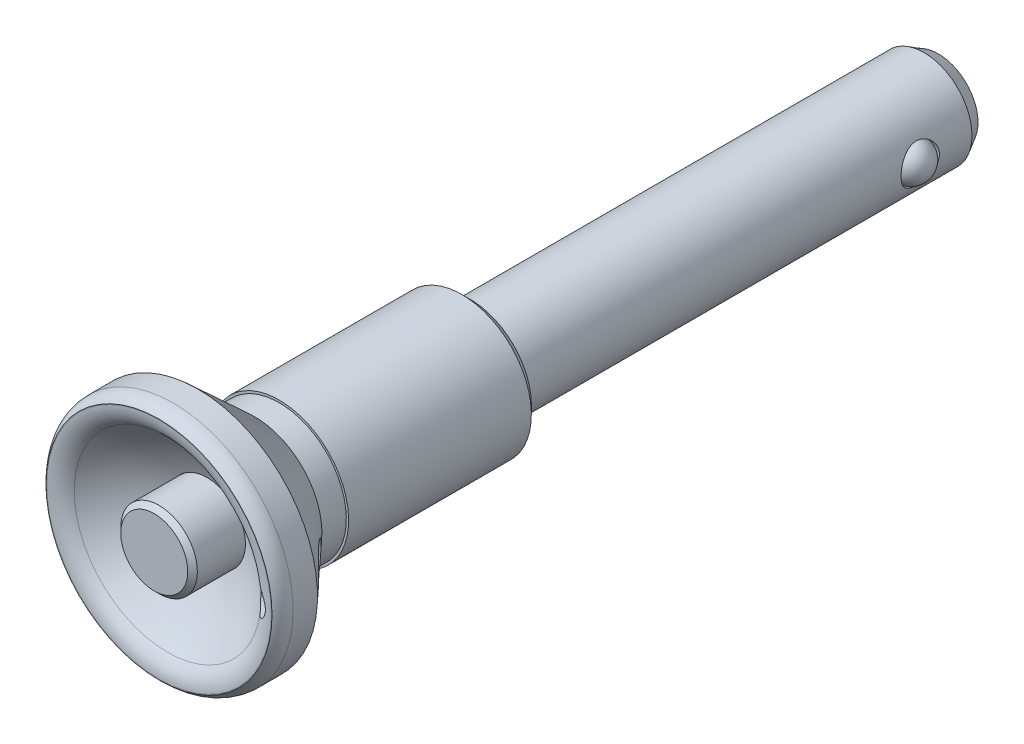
ISO-10303-21;
HEADER;
FILE_DESCRIPTION(('STEP AP214'),'2;1');
FILE_NAME('part.step','',(''),(''),'','','');
FILE_SCHEMA(('AUTOMOTIVE_DESIGN { 1 0 10303 214 1 1 1 1 }'));
ENDSEC;
DATA;
#1=APPLICATION_CONTEXT('core data for automotive mechanical design processes');
#2=APPLICATION_PROTOCOL_DEFINITION('international standard','automotive_design',2000,#1);
#3=PRODUCT_CONTEXT('',#1,'mechanical');
#4=PRODUCT('Part','Part','',(#3));
#5=PRODUCT_RELATED_PRODUCT_CATEGORY('part','',(#4));
#6=PRODUCT_DEFINITION_FORMATION('','',#4);
#7=PRODUCT_DEFINITION_CONTEXT('part definition',#1,'design');
#8=PRODUCT_DEFINITION('design','',#6,#7);
#9=PRODUCT_DEFINITION_SHAPE('','',#8);
#10=(LENGTH_UNIT() NAMED_UNIT(*) SI_UNIT(.MILLI.,.METRE.));
#11=(NAMED_UNIT(*) PLANE_ANGLE_UNIT() SI_UNIT($,.RADIAN.));
#12=(NAMED_UNIT(*) SI_UNIT($,.STERADIAN.) SOLID_ANGLE_UNIT());
#13=UNCERTAINTY_MEASURE_WITH_UNIT(LENGTH_MEASURE(1.E-05),#10,'distance_accuracy_value','');
#14=(GEOMETRIC_REPRESENTATION_CONTEXT(3) GLOBAL_UNCERTAINTY_ASSIGNED_CONTEXT((#13)) GLOBAL_UNIT_ASSIGNED_CONTEXT((#10,
#11,#12)) REPRESENTATION_CONTEXT('',''));
#15=CARTESIAN_POINT('',(0.,0.,0.));
#16=DIRECTION('',(0.,0.,1.));
#17=DIRECTION('',(1.,0.,0.));
#18=AXIS2_PLACEMENT_3D('',#15,#16,#17);
#19=CARTESIAN_POINT('',(0.,0.,-48.9));
#20=DIRECTION('',(0.,0.,-1.));
#21=DIRECTION('',(0.,1.,0.));
#22=AXIS2_PLACEMENT_3D('',#19,#20,#21);
#23=CYLINDRICAL_SURFACE('',#22,2.);
#24=CARTESIAN_POINT('',(0.,0.,-44.9));
#25=DIRECTION('',(0.,0.,-1.));
#26=DIRECTION('',(0.,1.,0.));
#27=AXIS2_PLACEMENT_3D('',#24,#25,#26);
#28=CIRCLE('',#27,2.);
#29=CARTESIAN_POINT('',(0.,2.,-44.9));
#30=VERTEX_POINT('',#29);
#31=EDGE_CURVE('E9',#30,#30,#28,.T.);
#32=ORIENTED_EDGE('',*,*,#31,.F.);
#33=EDGE_LOOP('',(#32));
#34=FACE_BOUND('',#33,.T.);
#35=CARTESIAN_POINT('',(0.,0.,-48.9));
#36=DIRECTION('',(0.,0.,-1.));
#37=DIRECTION('',(0.,1.,0.));
#38=AXIS2_PLACEMENT_3D('',#35,#36,#37);
#39=CIRCLE('',#38,2.);
#40=CARTESIAN_POINT('',(0.,2.,-48.9));
#41=VERTEX_POINT('',#40);
#42=EDGE_CURVE('E420',#41,#41,#39,.T.);
#43=ORIENTED_EDGE('',*,*,#42,.T.);
#44=EDGE_LOOP('',(#43));
#45=FACE_BOUND('',#44,.T.);
#46=ADVANCED_FACE('F14',(#34,#45),#23,.F.);
#47=CARTESIAN_POINT('',(0.,0.,-48.9));
#48=DIRECTION('',(0.,0.,-1.));
#49=DIRECTION('',(0.,1.,0.));
#50=AXIS2_PLACEMENT_3D('',#47,#48,#49);
#51=CYLINDRICAL_SURFACE('',#50,5.);
#52=CARTESIAN_POINT('',(4.58257569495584,2.,-42.));
#53=CARTESIAN_POINT('',(4.58258022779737,1.99999540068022,-42.107123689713));
#54=CARTESIAN_POINT('',(4.58638433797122,1.99134173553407,-42.2144262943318));
#55=CARTESIAN_POINT('',(4.601110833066,1.95706710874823,-42.4259390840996));
#56=CARTESIAN_POINT('',(4.61205140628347,1.93140279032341,-42.5301406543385));
#57=CARTESIAN_POINT('',(4.63960410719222,1.86423554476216,-42.7320518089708));
#58=CARTESIAN_POINT('',(4.65619484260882,1.82279228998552,-42.8297842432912));
#59=CARTESIAN_POINT('',(4.69314677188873,1.72542013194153,-43.0168853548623));
#60=CARTESIAN_POINT('',(4.71350714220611,1.66949439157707,-43.1062558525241));
#61=CARTESIAN_POINT('',(4.75700861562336,1.54132201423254,-43.2792603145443));
#62=CARTESIAN_POINT('',(4.78023917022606,1.46837936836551,-43.3623563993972));
#63=CARTESIAN_POINT('',(4.82612457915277,1.30970909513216,-43.5155290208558));
#64=CARTESIAN_POINT('',(4.84877922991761,1.22397701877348,-43.5856010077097));
#65=CARTESIAN_POINT('',(4.89203407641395,1.03800631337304,-43.7134063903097));
#66=CARTESIAN_POINT('',(4.9125180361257,0.9373289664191,-43.7705442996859));
#67=CARTESIAN_POINT('',(4.94803927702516,0.726825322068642,-43.8668435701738));
#68=CARTESIAN_POINT('',(4.96307877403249,0.617002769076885,-43.9060122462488));
#69=CARTESIAN_POINT('',(4.98538324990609,0.396966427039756,-43.9633414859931));
#70=CARTESIAN_POINT('',(4.99298936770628,0.28702898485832,-43.9824273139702));
#71=CARTESIAN_POINT('',(5.0008031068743,0.0652663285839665,-44.0020284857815));
#72=CARTESIAN_POINT('',(5.00101348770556,-0.0465581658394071,-44.0025507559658));
#73=CARTESIAN_POINT('',(4.99421962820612,-0.262232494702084,-43.9855172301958));
#74=CARTESIAN_POINT('',(4.98761996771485,-0.366177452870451,-43.9689752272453));
#75=CARTESIAN_POINT('',(4.96849291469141,-0.569673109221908,-43.920007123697));
#76=CARTESIAN_POINT('',(4.95596508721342,-0.669223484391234,-43.8875798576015));
#77=CARTESIAN_POINT('',(4.92596824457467,-0.862897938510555,-43.8073635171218));
#78=CARTESIAN_POINT('',(4.90842760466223,-0.956917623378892,-43.7593502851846));
#79=CARTESIAN_POINT('',(4.87014585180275,-1.13580815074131,-43.6495349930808));
#80=CARTESIAN_POINT('',(4.84940364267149,-1.22067584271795,-43.5877282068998));
#81=CARTESIAN_POINT('',(4.80521637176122,-1.38476882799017,-43.4473508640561));
#82=CARTESIAN_POINT('',(4.78168326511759,-1.46325784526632,-43.3679461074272));
#83=CARTESIAN_POINT('',(4.73561660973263,-1.60610741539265,-43.197009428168));
#84=CARTESIAN_POINT('',(4.71308339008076,-1.67046334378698,-43.1054735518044));
#85=CARTESIAN_POINT('',(4.67096897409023,-1.78490418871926,-42.9095809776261));
#86=CARTESIAN_POINT('',(4.65148914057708,-1.83453465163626,-42.8049351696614));
#87=CARTESIAN_POINT('',(4.61887590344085,-1.91517625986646,-42.5877845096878));
#88=CARTESIAN_POINT('',(4.60573837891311,-1.94619949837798,-42.4752848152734));
#89=CARTESIAN_POINT('',(4.58829759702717,-1.9869549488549,-42.2529642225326));
#90=CARTESIAN_POINT('',(4.58350366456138,-1.99787209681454,-42.1433995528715));
#91=CARTESIAN_POINT('',(4.58189497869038,-2.00156132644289,-41.9239227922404));
#92=CARTESIAN_POINT('',(4.58507780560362,-1.99433891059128,-41.8140108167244));
#93=CARTESIAN_POINT('',(4.59856044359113,-1.96303289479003,-41.6035410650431));
#94=CARTESIAN_POINT('',(4.60844457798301,-1.93993306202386,-41.5028070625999));
#95=CARTESIAN_POINT('',(4.6337005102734,-1.87880418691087,-41.3067115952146));
#96=CARTESIAN_POINT('',(4.64907352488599,-1.84077183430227,-41.2113513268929));
#97=CARTESIAN_POINT('',(4.68433781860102,-1.74913563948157,-41.0243976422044));
#98=CARTESIAN_POINT('',(4.70438704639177,-1.69496286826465,-40.9331138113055));
#99=CARTESIAN_POINT('',(4.74650385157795,-1.57316522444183,-40.7605170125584));
#100=CARTESIAN_POINT('',(4.76857224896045,-1.5055348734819,-40.6792081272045));
#101=CARTESIAN_POINT('',(4.81420915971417,-1.35284421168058,-40.5226265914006));
#102=CARTESIAN_POINT('',(4.83776807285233,-1.26686542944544,-40.4482434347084));
#103=CARTESIAN_POINT('',(4.88219794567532,-1.08308363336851,-40.3148229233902));
#104=CARTESIAN_POINT('',(4.90306879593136,-0.985280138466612,-40.2557861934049));
#105=CARTESIAN_POINT('',(4.9398371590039,-0.78027993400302,-40.1549523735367));
#106=CARTESIAN_POINT('',(4.9557358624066,-0.673085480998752,-40.1131511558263));
#107=CARTESIAN_POINT('',(4.98072713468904,-0.452393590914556,-40.0484511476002));
#108=CARTESIAN_POINT('',(4.98982339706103,-0.338899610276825,-40.0255420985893));
#109=CARTESIAN_POINT('',(4.99979008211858,-0.11681651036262,-40.0004952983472));
#110=CARTESIAN_POINT('',(5.00115846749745,-0.00839049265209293,-39.997099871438));
#111=CARTESIAN_POINT('',(4.99686042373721,0.20743383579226,-40.0078554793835));
#112=CARTESIAN_POINT('',(4.99119505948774,0.314832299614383,-40.0220038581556));
#113=CARTESIAN_POINT('',(4.97371513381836,0.522170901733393,-40.0665467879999));
#114=CARTESIAN_POINT('',(4.96209480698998,0.622238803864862,-40.0964289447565));
#115=CARTESIAN_POINT('',(4.93394947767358,0.815922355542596,-40.1710528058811));
#116=CARTESIAN_POINT('',(4.91742357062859,0.909536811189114,-40.2157972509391));
#117=CARTESIAN_POINT('',(4.88018094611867,1.09220303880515,-40.3211031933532));
#118=CARTESIAN_POINT('',(4.859311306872,1.18087037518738,-40.3822762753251));
#119=CARTESIAN_POINT('',(4.8158940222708,1.34705404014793,-40.517788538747));
#120=CARTESIAN_POINT('',(4.79334568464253,1.42456572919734,-40.5921331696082));
#121=CARTESIAN_POINT('',(4.74737767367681,1.57120121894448,-40.7573151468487));
#122=CARTESIAN_POINT('',(4.72399047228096,1.63950871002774,-40.8488885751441));
#123=CARTESIAN_POINT('',(4.6804965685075,1.75984762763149,-41.0429424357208));
#124=CARTESIAN_POINT('',(4.66039025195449,1.81187714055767,-41.1454241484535));
#125=CARTESIAN_POINT('',(4.62758914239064,1.89399048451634,-41.3490361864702));
#126=CARTESIAN_POINT('',(4.61439096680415,1.92562535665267,-41.4494616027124));
#127=CARTESIAN_POINT('',(4.5944582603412,1.97271990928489,-41.6544890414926));
#128=CARTESIAN_POINT('',(4.58770572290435,1.98822466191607,-41.7590785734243));
#129=CARTESIAN_POINT('',(4.5839176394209,1.99692202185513,-41.8867782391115));
#130=CARTESIAN_POINT('',(4.58341531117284,1.99807530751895,-41.9094014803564));
#131=CARTESIAN_POINT('',(4.58274384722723,1.9996148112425,-41.9546804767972));
#132=CARTESIAN_POINT('',(4.5825747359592,2.0000009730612,-41.9773362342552));
#133=CARTESIAN_POINT('',(4.58257569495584,2.,-42.));
#134=B_SPLINE_CURVE_WITH_KNOTS('',3,(#52,#53,#54,#55,#56,#57,#58,#59,#60,#61,#62,#63,#64,#65,
#66,#67,#68,#69,#70,#71,#72,#73,#74,#75,#76,#77,#78,#79,#80,#81,#82,#83,#84,#85,#86,#87,#88,#89,
#90,#91,#92,#93,#94,#95,#96,#97,#98,#99,#100,#101,#102,#103,#104,#105,#106,#107,#108,#109,#110,
#111,#112,#113,#114,#115,#116,#117,#118,#119,#120,#121,#122,#123,#124,#125,#126,#127,#128,#129,
#130,#131,#132,#133),.UNSPECIFIED.,.T.,.F.,(4,2,2,2,2,2,2,2,2,2,2,2,2,2,2,2,2,2,2,2,2,2,2,2,2,2,
2,2,2,2,2,2,2,2,2,2,2,2,2,2,4),(0.,0.321277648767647,0.643377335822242,0.964270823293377,
1.28509428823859,1.62255618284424,1.96013574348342,2.31102669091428,2.66177466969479,
2.99554182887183,3.32918445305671,3.64408644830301,3.95901155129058,4.27868300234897,
4.59846414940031,4.93924044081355,5.28012807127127,5.63064458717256,5.980933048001,
6.30982147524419,6.63861014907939,6.94867248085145,7.25880358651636,7.581511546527,
7.9043511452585,8.25103734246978,8.59773764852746,8.94435487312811,9.29078375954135,
9.61461039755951,9.938388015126,10.2522199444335,10.5661097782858,10.8938705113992,
11.2217671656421,11.5699625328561,11.9181988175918,12.2351666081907,12.5512463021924,
12.619212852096,12.6871843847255),.UNSPECIFIED.);
#135=CARTESIAN_POINT('',(4.58257569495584,2.,-42.));
#136=VERTEX_POINT('',#135);
#137=EDGE_CURVE('E401',#136,#136,#134,.T.);
#138=ORIENTED_EDGE('',*,*,#137,.T.);
#139=EDGE_LOOP('',(#138));
#140=FACE_BOUND('',#139,.T.);
#141=CARTESIAN_POINT('',(0.,0.,-47.4));
#142=DIRECTION('',(0.,0.,-1.));
#143=DIRECTION('',(0.,1.,0.));
#144=AXIS2_PLACEMENT_3D('',#141,#142,#143);
#145=CIRCLE('',#144,5.);
#146=CARTESIAN_POINT('',(0.,5.,-47.4));
#147=VERTEX_POINT('',#146);
#148=EDGE_CURVE('E67',#147,#147,#145,.T.);
#149=ORIENTED_EDGE('',*,*,#148,.F.);
#150=EDGE_LOOP('',(#149));
#151=FACE_BOUND('',#150,.T.);
#152=CARTESIAN_POINT('',(-4.58257569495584,2.,-42.));
#153=CARTESIAN_POINT('',(-4.58258022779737,1.99999540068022,-41.892876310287));
#154=CARTESIAN_POINT('',(-4.58638433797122,1.99134173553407,-41.7855737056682));
#155=CARTESIAN_POINT('',(-4.601110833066,1.95706710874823,-41.5740609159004));
#156=CARTESIAN_POINT('',(-4.61205140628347,1.93140279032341,-41.4698593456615));
#157=CARTESIAN_POINT('',(-4.63960410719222,1.86423554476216,-41.2679481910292));
#158=CARTESIAN_POINT('',(-4.65619484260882,1.82279228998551,-41.1702157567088));
#159=CARTESIAN_POINT('',(-4.69314677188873,1.72542013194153,-40.9831146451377));
#160=CARTESIAN_POINT('',(-4.71350714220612,1.66949439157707,-40.8937441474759));
#161=CARTESIAN_POINT('',(-4.75700861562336,1.54132201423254,-40.7207396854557));
#162=CARTESIAN_POINT('',(-4.78023917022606,1.46837936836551,-40.6376436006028));
#163=CARTESIAN_POINT('',(-4.82612457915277,1.30970909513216,-40.4844709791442));
#164=CARTESIAN_POINT('',(-4.84877922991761,1.22397701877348,-40.4143989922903));
#165=CARTESIAN_POINT('',(-4.89203407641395,1.03800631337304,-40.2865936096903));
#166=CARTESIAN_POINT('',(-4.9125180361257,0.937328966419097,-40.2294557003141));
#167=CARTESIAN_POINT('',(-4.94803927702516,0.726825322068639,-40.1331564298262));
#168=CARTESIAN_POINT('',(-4.96307877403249,0.617002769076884,-40.0939877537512));
#169=CARTESIAN_POINT('',(-4.98538324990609,0.396966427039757,-40.0366585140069));
#170=CARTESIAN_POINT('',(-4.99298936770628,0.28702898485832,-40.0175726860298));
#171=CARTESIAN_POINT('',(-5.0008031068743,0.0652663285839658,-39.9979715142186));
#172=CARTESIAN_POINT('',(-5.00101348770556,-0.0465581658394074,-39.9974492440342));
#173=CARTESIAN_POINT('',(-4.99421962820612,-0.262232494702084,-40.0144827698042));
#174=CARTESIAN_POINT('',(-4.98761996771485,-0.366177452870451,-40.0310247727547));
#175=CARTESIAN_POINT('',(-4.96849291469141,-0.569673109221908,-40.079992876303));
#176=CARTESIAN_POINT('',(-4.95596508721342,-0.669223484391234,-40.1124201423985));
#177=CARTESIAN_POINT('',(-4.92596824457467,-0.862897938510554,-40.1926364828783));
#178=CARTESIAN_POINT('',(-4.90842760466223,-0.956917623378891,-40.2406497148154));
#179=CARTESIAN_POINT('',(-4.87014585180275,-1.13580815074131,-40.3504650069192));
#180=CARTESIAN_POINT('',(-4.84940364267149,-1.22067584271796,-40.4122717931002));
#181=CARTESIAN_POINT('',(-4.80521637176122,-1.38476882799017,-40.5526491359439));
#182=CARTESIAN_POINT('',(-4.78168326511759,-1.46325784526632,-40.6320538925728));
#183=CARTESIAN_POINT('',(-4.73561660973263,-1.60610741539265,-40.802990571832));
#184=CARTESIAN_POINT('',(-4.71308339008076,-1.67046334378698,-40.8945264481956));
#185=CARTESIAN_POINT('',(-4.67096897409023,-1.78490418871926,-41.0904190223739));
#186=CARTESIAN_POINT('',(-4.65148914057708,-1.83453465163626,-41.1950648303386));
#187=CARTESIAN_POINT('',(-4.61887590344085,-1.91517625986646,-41.4122154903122));
#188=CARTESIAN_POINT('',(-4.60573837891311,-1.94619949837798,-41.5247151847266));
#189=CARTESIAN_POINT('',(-4.58829759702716,-1.9869549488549,-41.7470357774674));
#190=CARTESIAN_POINT('',(-4.58350366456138,-1.99787209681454,-41.8566004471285));
#191=CARTESIAN_POINT('',(-4.58189497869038,-2.00156132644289,-42.0760772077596));
#192=CARTESIAN_POINT('',(-4.58507780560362,-1.99433891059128,-42.1859891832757));
#193=CARTESIAN_POINT('',(-4.59856044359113,-1.96303289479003,-42.3964589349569));
#194=CARTESIAN_POINT('',(-4.60844457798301,-1.93993306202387,-42.4971929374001));
#195=CARTESIAN_POINT('',(-4.6337005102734,-1.87880418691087,-42.6932884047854));
#196=CARTESIAN_POINT('',(-4.64907352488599,-1.84077183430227,-42.7886486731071));
#197=CARTESIAN_POINT('',(-4.68433781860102,-1.74913563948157,-42.9756023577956));
#198=CARTESIAN_POINT('',(-4.70438704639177,-1.69496286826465,-43.0668861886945));
#199=CARTESIAN_POINT('',(-4.74650385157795,-1.57316522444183,-43.2394829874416));
#200=CARTESIAN_POINT('',(-4.76857224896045,-1.5055348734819,-43.3207918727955));
#201=CARTESIAN_POINT('',(-4.81420915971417,-1.35284421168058,-43.4773734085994));
#202=CARTESIAN_POINT('',(-4.83776807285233,-1.26686542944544,-43.5517565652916));
#203=CARTESIAN_POINT('',(-4.88219794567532,-1.08308363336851,-43.6851770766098));
#204=CARTESIAN_POINT('',(-4.90306879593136,-0.985280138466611,-43.7442138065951));
#205=CARTESIAN_POINT('',(-4.9398371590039,-0.780279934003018,-43.8450476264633));
#206=CARTESIAN_POINT('',(-4.9557358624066,-0.673085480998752,-43.8868488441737));
#207=CARTESIAN_POINT('',(-4.98072713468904,-0.452393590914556,-43.9515488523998));
#208=CARTESIAN_POINT('',(-4.98982339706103,-0.338899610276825,-43.9744579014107));
#209=CARTESIAN_POINT('',(-4.99979008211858,-0.11681651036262,-43.9995047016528));
#210=CARTESIAN_POINT('',(-5.00115846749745,-0.00839049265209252,-44.002900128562));
#211=CARTESIAN_POINT('',(-4.99686042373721,0.20743383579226,-43.9921445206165));
#212=CARTESIAN_POINT('',(-4.99119505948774,0.314832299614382,-43.9779961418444));
#213=CARTESIAN_POINT('',(-4.97371513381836,0.522170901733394,-43.9334532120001));
#214=CARTESIAN_POINT('',(-4.96209480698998,0.622238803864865,-43.9035710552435));
#215=CARTESIAN_POINT('',(-4.93394947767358,0.815922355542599,-43.8289471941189));
#216=CARTESIAN_POINT('',(-4.91742357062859,0.909536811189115,-43.7842027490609));
#217=CARTESIAN_POINT('',(-4.88018094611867,1.09220303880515,-43.6788968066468));
#218=CARTESIAN_POINT('',(-4.859311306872,1.18087037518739,-43.6177237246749));
#219=CARTESIAN_POINT('',(-4.8158940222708,1.34705404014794,-43.482211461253));
#220=CARTESIAN_POINT('',(-4.79334568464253,1.42456572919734,-43.4078668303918));
#221=CARTESIAN_POINT('',(-4.74737767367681,1.57120121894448,-43.2426848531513));
#222=CARTESIAN_POINT('',(-4.72399047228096,1.63950871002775,-43.1511114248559));
#223=CARTESIAN_POINT('',(-4.68049656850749,1.75984762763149,-42.9570575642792));
#224=CARTESIAN_POINT('',(-4.66039025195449,1.81187714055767,-42.8545758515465));
#225=CARTESIAN_POINT('',(-4.62758914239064,1.89399048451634,-42.6509638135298));
#226=CARTESIAN_POINT('',(-4.61439096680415,1.92562535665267,-42.5505383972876));
#227=CARTESIAN_POINT('',(-4.5944582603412,1.97271990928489,-42.3455109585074));
#228=CARTESIAN_POINT('',(-4.58770572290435,1.98822466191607,-42.2409214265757));
#229=CARTESIAN_POINT('',(-4.5839176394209,1.99692202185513,-42.1132217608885));
#230=CARTESIAN_POINT('',(-4.58341531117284,1.99807530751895,-42.0905985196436));
#231=CARTESIAN_POINT('',(-4.58274384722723,1.9996148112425,-42.0453195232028));
#232=CARTESIAN_POINT('',(-4.5825747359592,2.0000009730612,-42.0226637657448));
#233=CARTESIAN_POINT('',(-4.58257569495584,2.,-42.));
#234=B_SPLINE_CURVE_WITH_KNOTS('',3,(#152,#153,#154,#155,#156,#157,#158,#159,#160,#161,#162,
#163,#164,#165,#166,#167,#168,#169,#170,#171,#172,#173,#174,#175,#176,#177,#178,#179,#180,#181,
#182,#183,#184,#185,#186,#187,#188,#189,#190,#191,#192,#193,#194,#195,#196,#197,#198,#199,#200,
#201,#202,#203,#204,#205,#206,#207,#208,#209,#210,#211,#212,#213,#214,#215,#216,#217,#218,#219,
#220,#221,#222,#223,#224,#225,#226,#227,#228,#229,#230,#231,#232,#233),.UNSPECIFIED.,.T.,.F.,(4,
2,2,2,2,2,2,2,2,2,2,2,2,2,2,2,2,2,2,2,2,2,2,2,2,2,2,2,2,2,2,2,2,2,2,2,2,2,2,2,4),(0.,
0.321277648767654,0.643377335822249,0.964270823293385,1.2850942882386,1.62255618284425,
1.96013574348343,2.31102669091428,2.6617746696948,2.99554182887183,3.32918445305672,
3.64408644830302,3.95901155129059,4.27868300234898,4.5984641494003,4.93924044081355,
5.28012807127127,5.63064458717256,5.98093304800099,6.3098214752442,6.63861014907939,
6.94867248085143,7.25880358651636,7.581511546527,7.9043511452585,8.25103734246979,
8.59773764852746,8.94435487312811,9.29078375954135,9.61461039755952,9.93838801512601,
10.2522199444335,10.5661097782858,10.8938705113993,11.2217671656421,11.5699625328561,
11.9181988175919,12.2351666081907,12.5512463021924,12.619212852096,12.6871843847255),.UNSPECIFIED.);
#235=CARTESIAN_POINT('',(-4.58257569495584,2.,-42.));
#236=VERTEX_POINT('',#235);
#237=EDGE_CURVE('E61',#236,#236,#234,.T.);
#238=ORIENTED_EDGE('',*,*,#237,.T.);
#239=EDGE_LOOP('',(#238));
#240=FACE_BOUND('',#239,.T.);
#241=CARTESIAN_POINT('',(0.,0.,0.));
#242=DIRECTION('',(0.,0.,1.));
#243=DIRECTION('',(1.,0.,0.));
#244=AXIS2_PLACEMENT_3D('',#241,#242,#243);
#245=CIRCLE('',#244,5.);
#246=CARTESIAN_POINT('',(5.,0.,0.));
#247=VERTEX_POINT('',#246);
#248=EDGE_CURVE('E73',#247,#247,#245,.T.);
#249=ORIENTED_EDGE('',*,*,#248,.F.);
#250=EDGE_LOOP('',(#249));
#251=FACE_BOUND('',#250,.T.);
#252=ADVANCED_FACE('F395',(#140,#151,#240,#251),#51,.T.);
#253=CARTESIAN_POINT('',(2.,0.,-48.9));
#254=DIRECTION('',(0.,0.,-1.));
#255=DIRECTION('',(0.,1.,0.));
#256=AXIS2_PLACEMENT_3D('',#253,#254,#255);
#257=PLANE('',#256);
#258=CARTESIAN_POINT('',(0.,0.,-48.9));
#259=DIRECTION('',(0.,0.,-1.));
#260=DIRECTION('',(0.,1.,0.));
#261=AXIS2_PLACEMENT_3D('',#258,#259,#260);
#262=CIRCLE('',#261,4.13397459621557);
#263=CARTESIAN_POINT('',(0.,4.13397459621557,-48.9));
#264=VERTEX_POINT('',#263);
#265=EDGE_CURVE('E424',#264,#264,#262,.T.);
#266=ORIENTED_EDGE('',*,*,#265,.T.);
#267=EDGE_LOOP('',(#266));
#268=FACE_BOUND('',#267,.T.);
#269=ORIENTED_EDGE('',*,*,#42,.F.);
#270=EDGE_LOOP('',(#269));
#271=FACE_BOUND('',#270,.T.);
#272=ADVANCED_FACE('F437',(#268,#271),#257,.T.);
#273=CARTESIAN_POINT('',(0.,0.,-48.9));
#274=DIRECTION('',(0.,0.,1.));
#275=DIRECTION('',(0.,-1.,0.));
#276=AXIS2_PLACEMENT_3D('',#273,#274,#275);
#277=CONICAL_SURFACE('',#276,4.13397459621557,0.523598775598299);
#278=ORIENTED_EDGE('',*,*,#148,.T.);
#279=EDGE_LOOP('',(#278));
#280=FACE_BOUND('',#279,.T.);
#281=ORIENTED_EDGE('',*,*,#265,.F.);
#282=EDGE_LOOP('',(#281));
#283=FACE_BOUND('',#282,.T.);
#284=ADVANCED_FACE('F433',(#280,#283),#277,.T.);
#285=CARTESIAN_POINT('',(6.,0.,-42.));
#286=DIRECTION('',(1.,0.,0.));
#287=DIRECTION('',(0.,1.,0.));
#288=AXIS2_PLACEMENT_3D('',#285,#286,#287);
#289=CYLINDRICAL_SURFACE('',#288,2.);
#290=CARTESIAN_POINT('',(3.69295257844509,2.,-42.));
#291=CARTESIAN_POINT('',(3.69296124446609,1.99999252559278,-41.8950365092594));
#292=CARTESIAN_POINT('',(3.69749476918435,1.99168229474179,-41.7899198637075));
#293=CARTESIAN_POINT('',(3.71499510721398,1.95883523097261,-41.5828549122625));
#294=CARTESIAN_POINT('',(3.72798128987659,1.93426112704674,-41.4809144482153));
#295=CARTESIAN_POINT('',(3.76054820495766,1.87014699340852,-41.2835779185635));
#296=CARTESIAN_POINT('',(3.78009636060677,1.83068077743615,-41.1881522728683));
#297=CARTESIAN_POINT('',(3.82353505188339,1.73812635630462,-41.0052997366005));
#298=CARTESIAN_POINT('',(3.84742546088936,1.68503854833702,-40.9178726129));
#299=CARTESIAN_POINT('',(3.89903612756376,1.56210627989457,-40.7462961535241));
#300=CARTESIAN_POINT('',(3.92690909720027,1.49130855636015,-40.6628754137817));
#301=CARTESIAN_POINT('',(3.98210623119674,1.33695443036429,-40.5085333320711));
#302=CARTESIAN_POINT('',(4.00943013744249,1.25339217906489,-40.437617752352));
#303=CARTESIAN_POINT('',(4.0624063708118,1.06976932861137,-40.3061632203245));
#304=CARTESIAN_POINT('',(4.08786122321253,0.969021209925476,-40.2464976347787));
#305=CARTESIAN_POINT('',(4.1322840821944,0.757479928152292,-40.1452903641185));
#306=CARTESIAN_POINT('',(4.15125580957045,0.646692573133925,-40.1037382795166));
#307=CARTESIAN_POINT('',(4.17948005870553,0.425917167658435,-40.0427479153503));
#308=CARTESIAN_POINT('',(4.18928822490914,0.316352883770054,-40.0220384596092));
#309=CARTESIAN_POINT('',(4.20013773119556,0.0948978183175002,-39.9991585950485));
#310=CARTESIAN_POINT('',(4.20118382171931,-0.0169916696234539,-39.996978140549));
#311=CARTESIAN_POINT('',(4.1946744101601,-0.230460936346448,-40.0106738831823));
#312=CARTESIAN_POINT('',(4.18779244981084,-0.332156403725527,-40.0251360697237));
#313=CARTESIAN_POINT('',(4.1671904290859,-0.531473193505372,-40.0692085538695));
#314=CARTESIAN_POINT('',(4.15346986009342,-0.629094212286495,-40.0988199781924));
#315=CARTESIAN_POINT('',(4.12021451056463,-0.819264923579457,-40.1726068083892));
#316=CARTESIAN_POINT('',(4.10059733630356,-0.911719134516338,-40.2169896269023));
#317=CARTESIAN_POINT('',(4.05736238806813,-1.08810289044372,-40.3188060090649));
#318=CARTESIAN_POINT('',(4.03374315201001,-1.17202930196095,-40.376244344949));
#319=CARTESIAN_POINT('',(3.98232079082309,-1.33682830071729,-40.508356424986));
#320=CARTESIAN_POINT('',(3.95433239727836,-1.41678585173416,-40.5841006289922));
#321=CARTESIAN_POINT('',(3.89872441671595,-1.56333053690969,-40.7477715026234));
#322=CARTESIAN_POINT('',(3.87110507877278,-1.62990902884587,-40.8357059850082));
#323=CARTESIAN_POINT('',(3.81780436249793,-1.75125633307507,-41.0270633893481));
#324=CARTESIAN_POINT('',(3.79230552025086,-1.80520353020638,-41.1310630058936));
#325=CARTESIAN_POINT('',(3.74853610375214,-1.89443193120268,-41.3481814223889));
#326=CARTESIAN_POINT('',(3.73025862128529,-1.92973098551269,-41.4612913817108));
#327=CARTESIAN_POINT('',(3.70489726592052,-1.97796079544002,-41.6842923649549));
#328=CARTESIAN_POINT('',(3.69706613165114,-1.99239193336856,-41.7937711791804));
#329=CARTESIAN_POINT('',(3.69134421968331,-2.00297881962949,-42.013842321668));
#330=CARTESIAN_POINT('',(3.69344777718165,-1.99914498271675,-42.1244339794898));
#331=CARTESIAN_POINT('',(3.70656984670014,-1.97468704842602,-42.3324720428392));
#332=CARTESIAN_POINT('',(3.71672580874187,-1.95568631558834,-42.4301719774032));
#333=CARTESIAN_POINT('',(3.74358473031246,-1.90376463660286,-42.6208457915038));
#334=CARTESIAN_POINT('',(3.76028958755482,-1.87083965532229,-42.7138182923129));
#335=CARTESIAN_POINT('',(3.79928393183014,-1.79036865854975,-42.8972604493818));
#336=CARTESIAN_POINT('',(3.82179608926,-1.74221652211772,-42.9874151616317));
#337=CARTESIAN_POINT('',(3.86963561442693,-1.63320542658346,-43.1588668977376));
#338=CARTESIAN_POINT('',(3.89496439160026,-1.5723400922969,-43.2401594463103));
#339=CARTESIAN_POINT('',(3.94900124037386,-1.43163394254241,-43.401103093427));
#340=CARTESIAN_POINT('',(3.97776977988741,-1.35043069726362,-43.4795481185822));
#341=CARTESIAN_POINT('',(4.03293385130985,-1.17547949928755,-43.6220285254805));
#342=CARTESIAN_POINT('',(4.05932880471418,-1.08172850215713,-43.6860604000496));
#343=CARTESIAN_POINT('',(4.10741012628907,-0.881934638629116,-43.7987682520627));
#344=CARTESIAN_POINT('',(4.1290048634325,-0.775703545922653,-43.8471523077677));
#345=CARTESIAN_POINT('',(4.16436909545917,-0.555289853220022,-43.9249103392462));
#346=CARTESIAN_POINT('',(4.17814481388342,-0.441113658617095,-43.9542994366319));
#347=CARTESIAN_POINT('',(4.19540926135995,-0.218647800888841,-43.9909275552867));
#348=CARTESIAN_POINT('',(4.19968035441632,-0.110695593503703,-43.9998531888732));
#349=CARTESIAN_POINT('',(4.1998175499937,0.105223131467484,-44.0001430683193));
#350=CARTESIAN_POINT('',(4.19568607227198,0.213189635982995,-43.9915123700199));
#351=CARTESIAN_POINT('',(4.17993566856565,0.419731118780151,-43.9581010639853));
#352=CARTESIAN_POINT('',(4.168749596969,0.518493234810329,-43.9342532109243));
#353=CARTESIAN_POINT('',(4.1403533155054,0.71049162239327,-43.872267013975));
#354=CARTESIAN_POINT('',(4.12314216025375,0.80372702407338,-43.8341264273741));
#355=CARTESIAN_POINT('',(4.08331986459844,0.98669006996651,-43.7428034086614));
#356=CARTESIAN_POINT('',(4.06050114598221,1.07607281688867,-43.6890230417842));
#357=CARTESIAN_POINT('',(4.01195381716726,1.24493254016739,-43.5687268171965));
#358=CARTESIAN_POINT('',(3.98622388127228,1.32440496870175,-43.5022051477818));
#359=CARTESIAN_POINT('',(3.9317186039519,1.47877758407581,-43.3512584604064));
#360=CARTESIAN_POINT('',(3.90287905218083,1.55260530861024,-43.2657556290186));
#361=CARTESIAN_POINT('',(3.8474945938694,1.68518766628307,-43.0830092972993));
#362=CARTESIAN_POINT('',(3.82095142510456,1.74393094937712,-42.9857570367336));
#363=CARTESIAN_POINT('',(3.77299479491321,1.84543916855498,-42.7795828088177));
#364=CARTESIAN_POINT('',(3.75168341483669,1.88789405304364,-42.6704807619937));
#365=CARTESIAN_POINT('',(3.72647961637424,1.93689798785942,-42.5018569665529));
#366=CARTESIAN_POINT('',(3.71920915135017,1.95078018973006,-42.4448752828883));
#367=CARTESIAN_POINT('',(3.70719734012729,1.97351358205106,-42.3296687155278));
#368=CARTESIAN_POINT('',(3.7024541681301,1.98236840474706,-42.2714447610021));
#369=CARTESIAN_POINT('',(3.69705078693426,1.99241849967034,-42.1775698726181));
#370=CARTESIAN_POINT('',(3.69551719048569,1.99525904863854,-42.1421353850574));
#371=CARTESIAN_POINT('',(3.69346659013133,1.99905111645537,-42.0711398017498));
#372=CARTESIAN_POINT('',(3.69294964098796,2.00000253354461,-42.035578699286));
#373=CARTESIAN_POINT('',(3.69295257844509,2.,-42.));
#374=B_SPLINE_CURVE_WITH_KNOTS('',3,(#290,#291,#292,#293,#294,#295,#296,#297,#298,#299,#300,
#301,#302,#303,#304,#305,#306,#307,#308,#309,#310,#311,#312,#313,#314,#315,#316,#317,#318,#319,
#320,#321,#322,#323,#324,#325,#326,#327,#328,#329,#330,#331,#332,#333,#334,#335,#336,#337,#338,
#339,#340,#341,#342,#343,#344,#345,#346,#347,#348,#349,#350,#351,#352,#353,#354,#355,#356,#357,
#358,#359,#360,#361,#362,#363,#364,#365,#366,#367,#368,#369,#370,#371,#372,#373),.UNSPECIFIED.,
.T.,.F.,(4,2,2,2,2,2,2,2,2,2,2,2,2,2,2,2,2,2,2,2,2,2,2,2,2,2,2,2,2,2,2,2,2,2,2,2,2,2,2,2,2,4),
(0.,0.314747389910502,0.630218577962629,0.944146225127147,1.25806471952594,1.59535393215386,
1.93279816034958,2.2904080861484,2.64781242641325,2.98178553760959,3.31557757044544,
3.62297848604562,3.9304022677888,4.24233891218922,4.55438976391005,4.89383754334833,
5.2335038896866,5.59132862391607,5.94881021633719,6.27903319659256,6.60906790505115,
6.90786821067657,7.20675516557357,7.51947407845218,7.83235018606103,8.18030775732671,
8.52834990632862,8.88255362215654,9.2364750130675,9.55997846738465,9.88338877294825,
10.1886636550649,10.4939864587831,10.8130037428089,11.1321668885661,11.4803449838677,
11.8287842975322,12.1835611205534,12.3606240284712,12.5375588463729,12.6442406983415,
12.750928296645),.UNSPECIFIED.);
#375=CARTESIAN_POINT('',(3.85225966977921,1.67272059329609,-43.0963602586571));
#376=VERTEX_POINT('',#375);
#377=CARTESIAN_POINT('',(3.85225966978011,-1.67272059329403,-43.0963602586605));
#378=VERTEX_POINT('',#377);
#379=EDGE_CURVE('E63',#376,#378,#374,.T.);
#380=ORIENTED_EDGE('',*,*,#379,.F.);
#381=CARTESIAN_POINT('',(4.19974984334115,0.,-43.99999999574));
#382=CARTESIAN_POINT('',(4.19974979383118,0.112133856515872,-43.9999951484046));
#383=CARTESIAN_POINT('',(4.19927754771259,0.224413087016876,-43.9905315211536));
#384=CARTESIAN_POINT('',(4.19737987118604,0.445943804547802,-43.9528961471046));
#385=CARTESIAN_POINT('',(4.19595246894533,0.555188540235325,-43.9246857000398));
#386=CARTESIAN_POINT('',(4.1921221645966,0.76731378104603,-43.8503623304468));
#387=CARTESIAN_POINT('',(4.1897200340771,0.870199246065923,-43.8042635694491));
#388=CARTESIAN_POINT('',(4.1838985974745,1.06670436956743,-43.6955084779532));
#389=CARTESIAN_POINT('',(4.18047981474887,1.16032876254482,-43.6328606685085));
#390=CARTESIAN_POINT('',(4.17254294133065,1.33575977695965,-43.492765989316));
#391=CARTESIAN_POINT('',(4.16802447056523,1.41756229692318,-43.4153140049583));
#392=CARTESIAN_POINT('',(4.15774347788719,1.56703120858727,-43.2478047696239));
#393=CARTESIAN_POINT('',(4.15198042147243,1.63469150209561,-43.1577421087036));
#394=CARTESIAN_POINT('',(4.13889872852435,1.75400147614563,-42.9675249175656));
#395=CARTESIAN_POINT('',(4.13157812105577,1.80563066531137,-42.8673576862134));
#396=CARTESIAN_POINT('',(4.11478827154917,1.89126247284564,-42.6600522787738));
#397=CARTESIAN_POINT('',(4.1053223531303,1.92529209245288,-42.552925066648));
#398=CARTESIAN_POINT('',(4.08797788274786,1.96230917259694,-42.3903489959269));
#399=CARTESIAN_POINT('',(4.08173176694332,1.97228597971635,-42.3362647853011));
#400=CARTESIAN_POINT('',(4.06714094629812,1.98774141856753,-42.2278123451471));
#401=CARTESIAN_POINT('',(4.05879592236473,1.99321936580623,-42.1734440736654));
#402=CARTESIAN_POINT('',(4.04230132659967,1.99805364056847,-42.0921402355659));
#403=CARTESIAN_POINT('',(4.0361535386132,1.99910232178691,-42.0651242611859));
#404=CARTESIAN_POINT('',(4.02444072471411,1.99970372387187,-42.0347632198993));
#405=CARTESIAN_POINT('',(4.02250757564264,1.99977855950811,-42.0301214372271));
#406=CARTESIAN_POINT('',(4.01814107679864,1.99989236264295,-42.0211873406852));
#407=CARTESIAN_POINT('',(4.0157234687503,1.99993228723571,-42.0168888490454));
#408=CARTESIAN_POINT('',(4.01208715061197,1.99996240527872,-42.0122892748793));
#409=CARTESIAN_POINT('',(4.01145667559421,1.99996683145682,-42.011541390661));
#410=CARTESIAN_POINT('',(4.01012709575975,1.99997459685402,-42.0101050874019));
#411=CARTESIAN_POINT('',(4.0094278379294,1.99997793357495,-42.0094168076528));
#412=CARTESIAN_POINT('',(4.0079377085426,1.99998361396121,-42.0081222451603));
#413=CARTESIAN_POINT('',(4.0071456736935,1.99998594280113,-42.0075172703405));
#414=CARTESIAN_POINT('',(4.00546606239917,1.99998963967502,-42.0064591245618));
#415=CARTESIAN_POINT('',(4.00457899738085,1.99999101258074,-42.0060051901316));
#416=CARTESIAN_POINT('',(4.00309539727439,1.99999254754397,-42.0054637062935));
#417=CARTESIAN_POINT('',(4.00252608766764,1.99999297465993,-42.005302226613));
#418=CARTESIAN_POINT('',(4.00136845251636,1.99999355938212,-42.0050769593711));
#419=CARTESIAN_POINT('',(4.00078014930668,1.99999371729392,-42.0050130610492));
#420=CARTESIAN_POINT('',(3.99960008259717,1.99999377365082,-42.0049905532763));
#421=CARTESIAN_POINT('',(3.99900831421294,1.99999367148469,-42.0050321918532));
#422=CARTESIAN_POINT('',(3.99784054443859,1.99999320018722,-42.0052160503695));
#423=CARTESIAN_POINT('',(3.99726456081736,1.99999283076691,-42.0053583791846));
#424=CARTESIAN_POINT('',(3.99596613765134,1.99999164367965,-42.0057864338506));
#425=CARTESIAN_POINT('',(3.99525401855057,1.99999072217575,-42.0061030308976));
#426=CARTESIAN_POINT('',(3.99388863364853,1.99998832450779,-42.0068440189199));
#427=CARTESIAN_POINT('',(3.99323551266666,1.99998684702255,-42.0072686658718));
#428=CARTESIAN_POINT('',(3.99148747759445,1.9999818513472,-42.008559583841));
#429=CARTESIAN_POINT('',(3.99045448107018,1.99997764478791,-42.0095084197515));
#430=CARTESIAN_POINT('',(3.98852680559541,1.99996699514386,-42.011536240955));
#431=CARTESIAN_POINT('',(3.98763259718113,1.99996054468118,-42.0126156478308));
#432=CARTESIAN_POINT('',(3.98395592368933,1.99992720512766,-42.0174572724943));
#433=CARTESIAN_POINT('',(3.98166081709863,1.99988785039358,-42.0215770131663));
#434=CARTESIAN_POINT('',(3.97753827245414,1.99977908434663,-42.030041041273));
#435=CARTESIAN_POINT('',(3.97571429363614,1.99970946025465,-42.0343867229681));
#436=CARTESIAN_POINT('',(3.96598133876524,1.99922202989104,-42.0594419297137));
#437=CARTESIAN_POINT('',(3.96058685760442,1.99847042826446,-42.081080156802));
#438=CARTESIAN_POINT('',(3.95094475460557,1.9962386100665,-42.1245892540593));
#439=CARTESIAN_POINT('',(3.94670543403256,1.99475332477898,-42.1464606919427));
#440=CARTESIAN_POINT('',(3.9350941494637,1.98918869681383,-42.2122537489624));
#441=CARTESIAN_POINT('',(3.9288385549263,1.98400126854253,-42.2563147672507));
#442=CARTESIAN_POINT('',(3.9175034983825,1.97070199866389,-42.3439535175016));
#443=CARTESIAN_POINT('',(3.91242053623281,1.96259904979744,-42.3875323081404));
#444=CARTESIAN_POINT('',(3.89827773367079,1.93388686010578,-42.5176547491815));
#445=CARTESIAN_POINT('',(3.89034994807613,1.90888988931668,-42.6033988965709));
#446=CARTESIAN_POINT('',(3.87421219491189,1.83976683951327,-42.7923428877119));
#447=CARTESIAN_POINT('',(3.86644907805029,1.79238269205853,-42.8943953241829));
#448=CARTESIAN_POINT('',(3.85257985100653,1.68112524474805,-43.0892232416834));
#449=CARTESIAN_POINT('',(3.84647416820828,1.61724770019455,-43.1819963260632));
#450=CARTESIAN_POINT('',(3.83555894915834,1.4747938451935,-43.3555771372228));
#451=CARTESIAN_POINT('',(3.83074952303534,1.39621628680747,-43.4363838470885));
#452=CARTESIAN_POINT('',(3.82225891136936,1.22659246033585,-43.5836946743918));
#453=CARTESIAN_POINT('',(3.81857766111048,1.13554690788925,-43.6501996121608));
#454=CARTESIAN_POINT('',(3.8122496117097,0.943553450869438,-43.7670129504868));
#455=CARTESIAN_POINT('',(3.80960291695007,0.842604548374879,-43.8173197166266));
#456=CARTESIAN_POINT('',(3.80529420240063,0.633677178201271,-43.9002859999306));
#457=CARTESIAN_POINT('',(3.80363219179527,0.525698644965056,-43.9329453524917));
#458=CARTESIAN_POINT('',(3.80126727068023,0.30585183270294,-43.9796655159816));
#459=CARTESIAN_POINT('',(3.80056375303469,0.193986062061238,-43.9937381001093));
#460=CARTESIAN_POINT('',(3.8001038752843,-0.0305226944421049,-44.0029204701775));
#461=CARTESIAN_POINT('',(3.80034751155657,-0.143165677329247,-43.9980303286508));
#462=CARTESIAN_POINT('',(3.80178509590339,-0.365999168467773,-43.9694312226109));
#463=CARTESIAN_POINT('',(3.80297878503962,-0.47619033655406,-43.945727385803));
#464=CARTESIAN_POINT('',(3.80633396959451,-0.691023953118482,-43.8801856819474));
#465=CARTESIAN_POINT('',(3.8084954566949,-0.795666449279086,-43.8383479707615));
#466=CARTESIAN_POINT('',(3.81382337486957,-0.99644849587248,-43.7377286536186));
#467=CARTESIAN_POINT('',(3.8169899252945,-1.09258703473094,-43.6789450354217));
#468=CARTESIAN_POINT('',(3.82439824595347,-1.27362959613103,-43.5461160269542));
#469=CARTESIAN_POINT('',(3.82864008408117,-1.35853290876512,-43.4720696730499));
#470=CARTESIAN_POINT('',(3.83832255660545,-1.51475132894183,-43.3107773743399));
#471=CARTESIAN_POINT('',(3.84376398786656,-1.58605734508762,-43.2235226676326));
#472=CARTESIAN_POINT('',(3.85610678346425,-1.71297777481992,-43.0384161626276));
#473=CARTESIAN_POINT('',(3.8630077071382,-1.76859691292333,-42.9405675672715));
#474=CARTESIAN_POINT('',(3.87872632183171,-1.86264033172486,-42.7369651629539));
#475=CARTESIAN_POINT('',(3.88754441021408,-1.90106104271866,-42.6312097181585));
#476=CARTESIAN_POINT('',(3.90352637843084,-1.94500998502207,-42.469153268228));
#477=CARTESIAN_POINT('',(3.9093245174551,-1.95738820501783,-42.4144722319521));
#478=CARTESIAN_POINT('',(3.92228345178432,-1.97747981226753,-42.3044253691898));
#479=CARTESIAN_POINT('',(3.92944220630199,-1.98520011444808,-42.2490606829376));
#480=CARTESIAN_POINT('',(3.94292325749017,-1.99317462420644,-42.1672741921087));
#481=CARTESIAN_POINT('',(3.94775450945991,-1.99522444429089,-42.1407306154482));
#482=CARTESIAN_POINT('',(3.95873258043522,-1.99823673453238,-42.0878916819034));
#483=CARTESIAN_POINT('',(3.96486927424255,-1.99920723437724,-42.0615959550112));
#484=CARTESIAN_POINT('',(3.97736506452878,-1.99977986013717,-42.0303337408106));
#485=CARTESIAN_POINT('',(3.98011053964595,-1.99986240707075,-42.0241519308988));
#486=CARTESIAN_POINT('',(3.98496407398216,-1.9999354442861,-42.0162181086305));
#487=CARTESIAN_POINT('',(3.98641181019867,-1.99995127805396,-42.0140960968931));
#488=CARTESIAN_POINT('',(3.98888652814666,-1.99996921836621,-42.0111413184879));
#489=CARTESIAN_POINT('',(3.98976836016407,-1.99997424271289,-42.0101892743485));
#490=CARTESIAN_POINT('',(3.99166535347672,-1.9999824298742,-42.0084283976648));
#491=CARTESIAN_POINT('',(3.99267986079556,-1.99998560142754,-42.0076189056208));
#492=CARTESIAN_POINT('',(3.99432156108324,-1.99998914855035,-42.0065974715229));
#493=CARTESIAN_POINT('',(3.99488816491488,-1.99999012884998,-42.0062893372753));
#494=CARTESIAN_POINT('',(3.99606055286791,-1.99999172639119,-42.0057588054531));
#495=CARTESIAN_POINT('',(3.99666629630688,-1.99999234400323,-42.0055363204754));
#496=CARTESIAN_POINT('',(3.99791504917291,-1.99999325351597,-42.0051977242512));
#497=CARTESIAN_POINT('',(3.99855839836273,-1.99999354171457,-42.0050828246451));
#498=CARTESIAN_POINT('',(3.99985515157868,-1.99999380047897,-42.0049800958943));
#499=CARTESIAN_POINT('',(4.00050854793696,-1.99999377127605,-42.004992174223));
#500=CARTESIAN_POINT('',(4.00172710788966,-1.9999934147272,-42.0051326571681));
#501=CARTESIAN_POINT('',(4.00229389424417,-1.99999312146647,-42.005247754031));
#502=CARTESIAN_POINT('',(4.00340289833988,-1.99999226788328,-42.005563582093));
#503=CARTESIAN_POINT('',(4.00394509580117,-1.99999170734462,-42.0057643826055));
#504=CARTESIAN_POINT('',(4.00529385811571,-1.99998989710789,-42.0063673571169));
#505=CARTESIAN_POINT('',(4.00607796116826,-1.99998843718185,-42.0068192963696));
#506=CARTESIAN_POINT('',(4.00756863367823,-1.9999847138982,-42.0078364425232));
#507=CARTESIAN_POINT('',(4.00827495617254,-1.99998244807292,-42.0084019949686));
#508=CARTESIAN_POINT('',(4.01059095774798,-1.99997311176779,-42.01047125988));
#509=CARTESIAN_POINT('',(4.01203755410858,-1.99996381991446,-42.0121536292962));
#510=CARTESIAN_POINT('',(4.01468659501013,-1.99993919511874,-42.0157008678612));
#511=CARTESIAN_POINT('',(4.01588733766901,-1.99992382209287,-42.0175668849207));
#512=CARTESIAN_POINT('',(4.02118025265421,-1.99983629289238,-42.0265253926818));
#513=CARTESIAN_POINT('',(4.02434049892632,-1.99972278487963,-42.034145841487));
#514=CARTESIAN_POINT('',(4.02997192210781,-1.99940044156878,-42.0496004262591));
#515=CARTESIAN_POINT('',(4.03244059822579,-1.99919126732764,-42.0574352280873));
#516=CARTESIAN_POINT('',(4.04378981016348,-1.99791298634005,-42.096466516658));
#517=CARTESIAN_POINT('',(4.05009838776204,-1.99612756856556,-42.1283883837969));
#518=CARTESIAN_POINT('',(4.06138977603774,-1.99099225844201,-42.1923539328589));
#519=CARTESIAN_POINT('',(4.0663671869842,-1.98763614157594,-42.2243975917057));
#520=CARTESIAN_POINT('',(4.07852008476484,-1.97655830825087,-42.310040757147));
#521=CARTESIAN_POINT('',(4.08491199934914,-1.96741892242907,-42.3635932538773));
#522=CARTESIAN_POINT('',(4.09656729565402,-1.94480520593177,-42.4697748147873));
#523=CARTESIAN_POINT('',(4.10183224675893,-1.93133696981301,-42.5224050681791));
#524=CARTESIAN_POINT('',(4.11651428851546,-1.88443779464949,-42.6787636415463));
#525=CARTESIAN_POINT('',(4.12479374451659,-1.84453964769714,-42.7807488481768));
#526=CARTESIAN_POINT('',(4.13959090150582,-1.7486847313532,-42.9767318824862));
#527=CARTESIAN_POINT('',(4.14611138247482,-1.69275359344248,-43.0707421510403));
#528=CARTESIAN_POINT('',(4.15780698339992,-1.56631068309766,-43.248417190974));
#529=CARTESIAN_POINT('',(4.16298284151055,-1.49580694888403,-43.3320876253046));
#530=CARTESIAN_POINT('',(4.17235248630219,-1.33978638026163,-43.4891569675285));
#531=CARTESIAN_POINT('',(4.17651256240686,-1.25388603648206,-43.5621772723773));
#532=CARTESIAN_POINT('',(4.18376559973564,-1.07096203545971,-43.6928313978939));
#533=CARTESIAN_POINT('',(4.18685788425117,-0.973931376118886,-43.7504554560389));
#534=CARTESIAN_POINT('',(4.19203893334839,-0.771547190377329,-43.8486145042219));
#535=CARTESIAN_POINT('',(4.19412746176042,-0.666191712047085,-43.8891454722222));
#536=CARTESIAN_POINT('',(4.1973323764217,-0.450304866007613,-43.9518746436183));
#537=CARTESIAN_POINT('',(4.19845078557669,-0.339784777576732,-43.9741109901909));
#538=CARTESIAN_POINT('',(4.19931291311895,-0.190427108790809,-43.9912808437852));
#539=CARTESIAN_POINT('',(4.19947675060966,-0.152419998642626,-43.9945481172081));
#540=CARTESIAN_POINT('',(4.19969522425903,-0.0762808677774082,-43.9989085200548));
#541=CARTESIAN_POINT('',(4.19974986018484,-0.0381488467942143,-44.0000016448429));
#542=CARTESIAN_POINT('',(4.19974984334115,0.,-43.99999999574));
#543=B_SPLINE_CURVE_WITH_KNOTS('',3,(#381,#382,#383,#384,#385,#386,#387,#388,#389,#390,#391,
#392,#393,#394,#395,#396,#397,#398,#399,#400,#401,#402,#403,#404,#405,#406,#407,#408,#409,#410,
#411,#412,#413,#414,#415,#416,#417,#418,#419,#420,#421,#422,#423,#424,#425,#426,#427,#428,#429,
#430,#431,#432,#433,#434,#435,#436,#437,#438,#439,#440,#441,#442,#443,#444,#445,#446,#447,#448,
#449,#450,#451,#452,#453,#454,#455,#456,#457,#458,#459,#460,#461,#462,#463,#464,#465,#466,#467,
#468,#469,#470,#471,#472,#473,#474,#475,#476,#477,#478,#479,#480,#481,#482,#483,#484,#485,#486,
#487,#488,#489,#490,#491,#492,#493,#494,#495,#496,#497,#498,#499,#500,#501,#502,#503,#504,#505,
#506,#507,#508,#509,#510,#511,#512,#513,#514,#515,#516,#517,#518,#519,#520,#521,#522,#523,#524,
#525,#526,#527,#528,#529,#530,#531,#532,#533,#534,#535,#536,#537,#538,#539,#540,#541,#542),
.UNSPECIFIED.,.T.,.F.,(4,2,2,2,2,2,2,2,2,2,2,2,2,2,2,2,2,2,2,2,2,2,2,2,2,2,2,2,2,2,2,2,2,2,2,2,
2,2,2,2,2,2,2,2,2,2,2,2,2,2,2,2,2,2,2,2,2,2,2,2,2,2,2,2,2,2,2,2,2,2,2,2,2,2,2,2,2,2,2,2,4),(0.,
0.336257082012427,0.673210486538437,1.00989767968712,1.34641185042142,1.68304249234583,
2.01981799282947,2.35702221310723,2.69370754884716,2.85952431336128,3.02536630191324,
3.1080180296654,3.12310476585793,3.13776361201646,3.14069491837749,3.14363289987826,
3.14661273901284,3.14957727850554,3.15134542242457,3.15311155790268,3.1548818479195,
3.15665405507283,3.15897874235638,3.16130898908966,3.16549316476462,3.16969123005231,
3.18373019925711,3.19786949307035,3.26443595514,3.33146886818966,3.46565605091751,
3.59943736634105,3.86755945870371,4.20428771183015,4.54110271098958,4.87794631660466,
5.21477059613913,5.55162885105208,5.88849024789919,6.22513816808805,6.56178480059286,
6.89833971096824,7.23489172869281,7.5714837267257,7.90809698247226,8.24493452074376,
8.58167050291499,8.91847634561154,9.08742936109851,9.2561309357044,9.33735632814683,
9.41797330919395,9.43817093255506,9.44584485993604,9.44973012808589,9.45359692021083,
9.45552650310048,9.45745411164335,9.45940317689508,9.46135082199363,9.46307824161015,
9.46480706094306,9.46750640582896,9.47021408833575,9.47681912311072,9.48346843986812,
9.50804380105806,9.53270691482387,9.63013616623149,9.72795483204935,9.89178899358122,
10.0553934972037,10.3832372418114,10.7105597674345,11.0377022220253,11.3745550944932,
11.7116210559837,12.0487662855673,12.3852067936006,12.4996039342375,12.6140013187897),.UNSPECIFIED.);
#544=EDGE_CURVE('E32',#378,#376,#543,.T.);
#545=ORIENTED_EDGE('',*,*,#544,.F.);
#546=EDGE_LOOP('',(#380,#545));
#547=FACE_BOUND('',#546,.T.);
#548=ORIENTED_EDGE('',*,*,#137,.F.);
#549=EDGE_LOOP('',(#548));
#550=FACE_BOUND('',#549,.T.);
#551=ADVANCED_FACE('F64',(#547,#550),#289,.F.);
#552=CARTESIAN_POINT('',(-3.69295257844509,2.,-42.));
#553=CARTESIAN_POINT('',(-3.69296124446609,1.99999252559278,-42.1049634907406));
#554=CARTESIAN_POINT('',(-3.69749476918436,1.99168229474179,-42.2100801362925));
#555=CARTESIAN_POINT('',(-3.71499510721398,1.95883523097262,-42.4171450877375));
#556=CARTESIAN_POINT('',(-3.72798128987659,1.93426112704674,-42.5190855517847));
#557=CARTESIAN_POINT('',(-3.76054820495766,1.87014699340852,-42.7164220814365));
#558=CARTESIAN_POINT('',(-3.78009636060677,1.83068077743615,-42.8118477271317));
#559=CARTESIAN_POINT('',(-3.82353505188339,1.73812635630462,-42.9947002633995));
#560=CARTESIAN_POINT('',(-3.84742546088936,1.68503854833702,-43.0821273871));
#561=CARTESIAN_POINT('',(-3.89903612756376,1.56210627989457,-43.253703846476));
#562=CARTESIAN_POINT('',(-3.92690909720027,1.49130855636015,-43.3371245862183));
#563=CARTESIAN_POINT('',(-3.98210623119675,1.33695443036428,-43.4914666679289));
#564=CARTESIAN_POINT('',(-4.00943013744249,1.25339217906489,-43.562382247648));
#565=CARTESIAN_POINT('',(-4.0624063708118,1.06976932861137,-43.6938367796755));
#566=CARTESIAN_POINT('',(-4.08786122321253,0.969021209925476,-43.7535023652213));
#567=CARTESIAN_POINT('',(-4.1322840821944,0.757479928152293,-43.8547096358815));
#568=CARTESIAN_POINT('',(-4.15125580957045,0.646692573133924,-43.8962617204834));
#569=CARTESIAN_POINT('',(-4.17948005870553,0.425917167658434,-43.9572520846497));
#570=CARTESIAN_POINT('',(-4.18928822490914,0.316352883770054,-43.9779615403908));
#571=CARTESIAN_POINT('',(-4.20013773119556,0.0948978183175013,-44.0008414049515));
#572=CARTESIAN_POINT('',(-4.20118382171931,-0.0169916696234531,-44.003021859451));
#573=CARTESIAN_POINT('',(-4.1946744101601,-0.230460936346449,-43.9893261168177));
#574=CARTESIAN_POINT('',(-4.18779244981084,-0.332156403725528,-43.9748639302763));
#575=CARTESIAN_POINT('',(-4.1671904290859,-0.531473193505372,-43.9307914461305));
#576=CARTESIAN_POINT('',(-4.15346986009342,-0.629094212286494,-43.9011800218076));
#577=CARTESIAN_POINT('',(-4.12021451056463,-0.819264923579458,-43.8273931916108));
#578=CARTESIAN_POINT('',(-4.10059733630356,-0.911719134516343,-43.7830103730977));
#579=CARTESIAN_POINT('',(-4.05736238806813,-1.08810289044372,-43.6811939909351));
#580=CARTESIAN_POINT('',(-4.03374315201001,-1.17202930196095,-43.623755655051));
#581=CARTESIAN_POINT('',(-3.98232079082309,-1.33682830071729,-43.491643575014));
#582=CARTESIAN_POINT('',(-3.95433239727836,-1.41678585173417,-43.4158993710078));
#583=CARTESIAN_POINT('',(-3.89872441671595,-1.56333053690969,-43.2522284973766));
#584=CARTESIAN_POINT('',(-3.87110507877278,-1.62990902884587,-43.1642940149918));
#585=CARTESIAN_POINT('',(-3.81780436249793,-1.75125633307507,-42.9729366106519));
#586=CARTESIAN_POINT('',(-3.79230552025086,-1.80520353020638,-42.8689369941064));
#587=CARTESIAN_POINT('',(-3.74853610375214,-1.89443193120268,-42.6518185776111));
#588=CARTESIAN_POINT('',(-3.73025862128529,-1.92973098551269,-42.5387086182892));
#589=CARTESIAN_POINT('',(-3.70489726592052,-1.97796079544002,-42.3157076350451));
#590=CARTESIAN_POINT('',(-3.69706613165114,-1.99239193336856,-42.2062288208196));
#591=CARTESIAN_POINT('',(-3.69134421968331,-2.00297881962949,-41.986157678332));
#592=CARTESIAN_POINT('',(-3.69344777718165,-1.99914498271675,-41.8755660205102));
#593=CARTESIAN_POINT('',(-3.70656984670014,-1.97468704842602,-41.6675279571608));
#594=CARTESIAN_POINT('',(-3.71672580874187,-1.95568631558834,-41.5698280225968));
#595=CARTESIAN_POINT('',(-3.74358473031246,-1.90376463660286,-41.3791542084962));
#596=CARTESIAN_POINT('',(-3.76028958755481,-1.8708396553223,-41.2861817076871));
#597=CARTESIAN_POINT('',(-3.79928393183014,-1.79036865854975,-41.1027395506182));
#598=CARTESIAN_POINT('',(-3.82179608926,-1.74221652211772,-41.0125848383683));
#599=CARTESIAN_POINT('',(-3.86963561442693,-1.63320542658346,-40.8411331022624));
#600=CARTESIAN_POINT('',(-3.89496439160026,-1.5723400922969,-40.7598405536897));
#601=CARTESIAN_POINT('',(-3.94900124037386,-1.43163394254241,-40.598896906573));
#602=CARTESIAN_POINT('',(-3.97776977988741,-1.35043069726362,-40.5204518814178));
#603=CARTESIAN_POINT('',(-4.03293385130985,-1.17547949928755,-40.3779714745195));
#604=CARTESIAN_POINT('',(-4.05932880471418,-1.08172850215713,-40.3139395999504));
#605=CARTESIAN_POINT('',(-4.10741012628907,-0.881934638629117,-40.2012317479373));
#606=CARTESIAN_POINT('',(-4.12900486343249,-0.775703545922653,-40.1528476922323));
#607=CARTESIAN_POINT('',(-4.16436909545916,-0.555289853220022,-40.0750896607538));
#608=CARTESIAN_POINT('',(-4.17814481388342,-0.441113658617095,-40.0457005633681));
#609=CARTESIAN_POINT('',(-4.19540926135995,-0.21864780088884,-40.0090724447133));
#610=CARTESIAN_POINT('',(-4.19968035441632,-0.110695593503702,-40.0001468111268));
#611=CARTESIAN_POINT('',(-4.1998175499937,0.105223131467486,-39.9998569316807));
#612=CARTESIAN_POINT('',(-4.19568607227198,0.213189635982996,-40.0084876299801));
#613=CARTESIAN_POINT('',(-4.17993566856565,0.41973111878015,-40.0418989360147));
#614=CARTESIAN_POINT('',(-4.168749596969,0.518493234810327,-40.0657467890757));
#615=CARTESIAN_POINT('',(-4.1403533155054,0.710491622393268,-40.127732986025));
#616=CARTESIAN_POINT('',(-4.12314216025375,0.803727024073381,-40.1658735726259));
#617=CARTESIAN_POINT('',(-4.08331986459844,0.986690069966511,-40.2571965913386));
#618=CARTESIAN_POINT('',(-4.06050114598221,1.07607281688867,-40.3109769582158));
#619=CARTESIAN_POINT('',(-4.01195381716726,1.24493254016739,-40.4312731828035));
#620=CARTESIAN_POINT('',(-3.98622388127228,1.32440496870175,-40.4977948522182));
#621=CARTESIAN_POINT('',(-3.9317186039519,1.47877758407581,-40.6487415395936));
#622=CARTESIAN_POINT('',(-3.90287905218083,1.55260530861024,-40.7342443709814));
#623=CARTESIAN_POINT('',(-3.8474945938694,1.68518766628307,-40.9169907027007));
#624=CARTESIAN_POINT('',(-3.82095142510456,1.74393094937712,-41.0142429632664));
#625=CARTESIAN_POINT('',(-3.77299479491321,1.84543916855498,-41.2204171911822));
#626=CARTESIAN_POINT('',(-3.75168341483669,1.88789405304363,-41.3295192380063));
#627=CARTESIAN_POINT('',(-3.72647961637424,1.93689798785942,-41.4981430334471));
#628=CARTESIAN_POINT('',(-3.71920915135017,1.95078018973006,-41.5551247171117));
#629=CARTESIAN_POINT('',(-3.70719734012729,1.97351358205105,-41.6703312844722));
#630=CARTESIAN_POINT('',(-3.7024541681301,1.98236840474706,-41.7285552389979));
#631=CARTESIAN_POINT('',(-3.69705078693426,1.99241849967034,-41.8224301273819));
#632=CARTESIAN_POINT('',(-3.69551719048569,1.99525904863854,-41.8578646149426));
#633=CARTESIAN_POINT('',(-3.69346659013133,1.99905111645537,-41.9288601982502));
#634=CARTESIAN_POINT('',(-3.69294964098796,2.00000253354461,-41.964421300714));
#635=CARTESIAN_POINT('',(-3.69295257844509,2.,-42.));
#636=B_SPLINE_CURVE_WITH_KNOTS('',3,(#552,#553,#554,#555,#556,#557,#558,#559,#560,#561,#562,
#563,#564,#565,#566,#567,#568,#569,#570,#571,#572,#573,#574,#575,#576,#577,#578,#579,#580,#581,
#582,#583,#584,#585,#586,#587,#588,#589,#590,#591,#592,#593,#594,#595,#596,#597,#598,#599,#600,
#601,#602,#603,#604,#605,#606,#607,#608,#609,#610,#611,#612,#613,#614,#615,#616,#617,#618,#619,
#620,#621,#622,#623,#624,#625,#626,#627,#628,#629,#630,#631,#632,#633,#634,#635),.UNSPECIFIED.,
.T.,.F.,(4,2,2,2,2,2,2,2,2,2,2,2,2,2,2,2,2,2,2,2,2,2,2,2,2,2,2,2,2,2,2,2,2,2,2,2,2,2,2,2,2,4),
(0.,0.314747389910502,0.630218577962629,0.944146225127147,1.25806471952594,1.59535393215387,
1.93279816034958,2.2904080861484,2.64781242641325,2.98178553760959,3.31557757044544,
3.62297848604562,3.9304022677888,4.24233891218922,4.55438976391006,4.89383754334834,
5.2335038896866,5.59132862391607,5.94881021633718,6.27903319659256,6.60906790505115,
6.90786821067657,7.20675516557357,7.51947407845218,7.83235018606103,8.1803077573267,
8.52834990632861,8.88255362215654,9.23647501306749,9.55997846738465,9.88338877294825,
10.1886636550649,10.4939864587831,10.8130037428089,11.1321668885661,11.4803449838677,
11.8287842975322,12.1835611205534,12.3606240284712,12.5375588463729,12.6442406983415,
12.750928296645),.UNSPECIFIED.);
#637=CARTESIAN_POINT('',(-3.85225966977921,-1.67272059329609,-43.0963602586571));
#638=VERTEX_POINT('',#637);
#639=CARTESIAN_POINT('',(-3.85225966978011,1.67272059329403,-43.0963602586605));
#640=VERTEX_POINT('',#639);
#641=EDGE_CURVE('E70',#638,#640,#636,.T.);
#642=ORIENTED_EDGE('',*,*,#641,.F.);
#643=CARTESIAN_POINT('',(-4.19974984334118,0.,-43.99999999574));
#644=CARTESIAN_POINT('',(-4.19974979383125,-0.11213385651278,-43.9999951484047));
#645=CARTESIAN_POINT('',(-4.19927754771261,-0.224413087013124,-43.9905315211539));
#646=CARTESIAN_POINT('',(-4.19737987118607,-0.445943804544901,-43.9528961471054));
#647=CARTESIAN_POINT('',(-4.19595246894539,-0.555188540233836,-43.9246857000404));
#648=CARTESIAN_POINT('',(-4.19212216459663,-0.767313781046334,-43.8503623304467));
#649=CARTESIAN_POINT('',(-4.18972003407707,-0.870199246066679,-43.8042635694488));
#650=CARTESIAN_POINT('',(-4.18389859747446,-1.06670436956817,-43.6955084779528));
#651=CARTESIAN_POINT('',(-4.18047981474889,-1.16032876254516,-43.6328606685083));
#652=CARTESIAN_POINT('',(-4.17254294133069,-1.33575977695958,-43.4927659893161));
#653=CARTESIAN_POINT('',(-4.16802447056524,-1.41756229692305,-43.4153140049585));
#654=CARTESIAN_POINT('',(-4.1577434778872,-1.56703120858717,-43.247804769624));
#655=CARTESIAN_POINT('',(-4.15198042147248,-1.63469150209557,-43.1577421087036));
#656=CARTESIAN_POINT('',(-4.13889872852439,-1.75400147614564,-42.9675249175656));
#657=CARTESIAN_POINT('',(-4.13157812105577,-1.80563066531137,-42.8673576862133));
#658=CARTESIAN_POINT('',(-4.11478827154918,-1.89126247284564,-42.6600522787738));
#659=CARTESIAN_POINT('',(-4.10532235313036,-1.92529209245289,-42.552925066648));
#660=CARTESIAN_POINT('',(-4.08797788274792,-1.96230917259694,-42.3903489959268));
#661=CARTESIAN_POINT('',(-4.08173176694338,-1.97228597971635,-42.336264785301));
#662=CARTESIAN_POINT('',(-4.06714094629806,-1.98774141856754,-42.2278123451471));
#663=CARTESIAN_POINT('',(-4.05879592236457,-1.99321936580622,-42.1734440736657));
#664=CARTESIAN_POINT('',(-4.04230132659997,-1.99805364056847,-42.0921402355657));
#665=CARTESIAN_POINT('',(-4.03615353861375,-1.99910232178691,-42.0651242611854));
#666=CARTESIAN_POINT('',(-4.02444072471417,-1.99970372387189,-42.034763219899));
#667=CARTESIAN_POINT('',(-4.02250757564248,-1.99977855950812,-42.0301214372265));
#668=CARTESIAN_POINT('',(-4.0181410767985,-1.99989236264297,-42.0211873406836));
#669=CARTESIAN_POINT('',(-4.01572346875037,-1.99993228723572,-42.0168888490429));
#670=CARTESIAN_POINT('',(-4.01208715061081,-1.99996240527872,-42.0122892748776));
#671=CARTESIAN_POINT('',(-4.01145667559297,-1.99996683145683,-42.0115413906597));
#672=CARTESIAN_POINT('',(-4.01012709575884,-1.99997459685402,-42.0101050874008));
#673=CARTESIAN_POINT('',(-4.0094278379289,-1.99997793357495,-42.0094168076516));
#674=CARTESIAN_POINT('',(-4.00793770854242,-1.99998361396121,-42.0081222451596));
#675=CARTESIAN_POINT('',(-4.00714567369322,-1.99998594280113,-42.0075172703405));
#676=CARTESIAN_POINT('',(-4.00546606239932,-1.99998963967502,-42.0064591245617));
#677=CARTESIAN_POINT('',(-4.0045789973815,-1.99999101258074,-42.006005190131));
#678=CARTESIAN_POINT('',(-4.00309539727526,-1.99999254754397,-42.0054637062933));
#679=CARTESIAN_POINT('',(-4.0025260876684,-1.99999297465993,-42.0053022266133));
#680=CARTESIAN_POINT('',(-4.00136845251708,-1.99999355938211,-42.0050769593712));
#681=CARTESIAN_POINT('',(-4.00078014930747,-1.99999371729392,-42.0050130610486));
#682=CARTESIAN_POINT('',(-3.99960008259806,-1.99999377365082,-42.0049905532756));
#683=CARTESIAN_POINT('',(-3.99900831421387,-1.99999367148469,-42.0050321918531));
#684=CARTESIAN_POINT('',(-3.99784054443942,-1.99999320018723,-42.0052160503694));
#685=CARTESIAN_POINT('',(-3.99726456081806,-1.99999283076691,-42.0053583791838));
#686=CARTESIAN_POINT('',(-3.9959661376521,-1.99999164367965,-42.0057864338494));
#687=CARTESIAN_POINT('',(-3.99525401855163,-1.99999072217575,-42.006103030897));
#688=CARTESIAN_POINT('',(-3.99388863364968,-1.9999883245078,-42.0068440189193));
#689=CARTESIAN_POINT('',(-3.99323551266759,-1.99998684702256,-42.0072686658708));
#690=CARTESIAN_POINT('',(-3.99148747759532,-1.99998185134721,-42.0085595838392));
#691=CARTESIAN_POINT('',(-3.99045448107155,-1.99997764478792,-42.00950841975));
#692=CARTESIAN_POINT('',(-3.98852680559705,-1.99996699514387,-42.0115362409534));
#693=CARTESIAN_POINT('',(-3.98763259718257,-1.99996054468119,-42.0126156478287));
#694=CARTESIAN_POINT('',(-3.98395592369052,-1.99992720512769,-42.0174572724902));
#695=CARTESIAN_POINT('',(-3.9816608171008,-1.99988785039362,-42.0215770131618));
#696=CARTESIAN_POINT('',(-3.9775382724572,-1.99977908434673,-42.0300410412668));
#697=CARTESIAN_POINT('',(-3.97571429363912,-1.99970946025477,-42.0343867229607));
#698=CARTESIAN_POINT('',(-3.96598133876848,-1.9992220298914,-42.0594419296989));
#699=CARTESIAN_POINT('',(-3.96058685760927,-1.99847042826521,-42.081080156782));
#700=CARTESIAN_POINT('',(-3.95094475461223,-1.99623861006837,-42.1245892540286));
#701=CARTESIAN_POINT('',(-3.94670543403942,-1.99475332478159,-42.1464606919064));
#702=CARTESIAN_POINT('',(-3.93509414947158,-1.98918869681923,-42.2122537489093));
#703=CARTESIAN_POINT('',(-3.92883855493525,-1.98400126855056,-42.2563147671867));
#704=CARTESIAN_POINT('',(-3.91750349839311,-1.97070199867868,-42.3439535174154));
#705=CARTESIAN_POINT('',(-3.912420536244,-1.96259904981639,-42.3875323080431));
#706=CARTESIAN_POINT('',(-3.89827773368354,-1.93388686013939,-42.517654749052));
#707=CARTESIAN_POINT('',(-3.89034994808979,-1.90888988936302,-42.603398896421));
#708=CARTESIAN_POINT('',(-3.87421219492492,-1.83976683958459,-42.7923428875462));
#709=CARTESIAN_POINT('',(-3.86644907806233,-1.79238269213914,-42.8943953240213));
#710=CARTESIAN_POINT('',(-3.85257985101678,-1.68112524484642,-43.0892232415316));
#711=CARTESIAN_POINT('',(-3.84647416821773,-1.61724770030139,-43.181996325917));
#712=CARTESIAN_POINT('',(-3.8355589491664,-1.4747938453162,-43.3555771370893));
#713=CARTESIAN_POINT('',(-3.8307495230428,-1.39621628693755,-43.4363838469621));
#714=CARTESIAN_POINT('',(-3.8222589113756,-1.22659246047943,-43.5836946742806));
#715=CARTESIAN_POINT('',(-3.81857766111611,-1.13554690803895,-43.6501996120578));
#716=CARTESIAN_POINT('',(-3.81224961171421,-0.943553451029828,-43.7670129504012));
#717=CARTESIAN_POINT('',(-3.80960291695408,-0.84260454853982,-43.8173197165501));
#718=CARTESIAN_POINT('',(-3.80529420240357,-0.633677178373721,-43.9002859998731));
#719=CARTESIAN_POINT('',(-3.80363219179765,-0.525698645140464,-43.932945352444));
#720=CARTESIAN_POINT('',(-3.80126727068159,-0.305851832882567,-43.9796655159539));
#721=CARTESIAN_POINT('',(-3.80056375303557,-0.193986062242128,-43.9937381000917));
#722=CARTESIAN_POINT('',(-3.80010387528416,0.0305226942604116,-44.0029204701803));
#723=CARTESIAN_POINT('',(-3.80034751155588,0.143165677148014,-43.9980303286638));
#724=CARTESIAN_POINT('',(-3.80178509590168,0.365999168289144,-43.9694312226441));
#725=CARTESIAN_POINT('',(-3.80297878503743,0.476190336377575,-43.9457273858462));
#726=CARTESIAN_POINT('',(-3.80633396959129,0.691023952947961,-43.8801856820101));
#727=CARTESIAN_POINT('',(-3.80849545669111,0.795666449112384,-43.8383479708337));
#728=CARTESIAN_POINT('',(-3.81382337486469,0.996448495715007,-43.7377286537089));
#729=CARTESIAN_POINT('',(-3.8169899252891,1.09258703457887,-43.6789450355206));
#730=CARTESIAN_POINT('',(-3.82439824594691,1.27362959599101,-43.5461160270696));
#731=CARTESIAN_POINT('',(-3.82864008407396,1.35853290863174,-43.4720696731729));
#732=CARTESIAN_POINT('',(-3.83832255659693,1.51475132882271,-43.3107773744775));
#733=CARTESIAN_POINT('',(-3.84376398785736,1.58605734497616,-43.223522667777));
#734=CARTESIAN_POINT('',(-3.85610678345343,1.71297777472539,-43.0384161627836));
#735=CARTESIAN_POINT('',(-3.86300770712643,1.76859691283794,-42.9405675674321));
#736=CARTESIAN_POINT('',(-3.87872632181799,1.86264033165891,-42.7369651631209));
#737=CARTESIAN_POINT('',(-3.88754441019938,1.9010610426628,-42.6312097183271));
#738=CARTESIAN_POINT('',(-3.90352637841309,1.94500998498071,-42.4691532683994));
#739=CARTESIAN_POINT('',(-3.90932451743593,1.95738820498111,-42.4144722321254));
#740=CARTESIAN_POINT('',(-3.92228345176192,1.97747981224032,-42.3044253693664));
#741=CARTESIAN_POINT('',(-3.92944220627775,1.98520011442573,-42.2490606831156));
#742=CARTESIAN_POINT('',(-3.94292325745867,1.99317462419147,-42.1672741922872));
#743=CARTESIAN_POINT('',(-3.94775450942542,1.99522444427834,-42.1407306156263));
#744=CARTESIAN_POINT('',(-3.95873258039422,1.99823673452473,-42.0878916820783));
#745=CARTESIAN_POINT('',(-3.96486927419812,1.999207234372,-42.0615959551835));
#746=CARTESIAN_POINT('',(-3.97736506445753,1.99977986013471,-42.0303337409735));
#747=CARTESIAN_POINT('',(-3.98011053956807,1.99986240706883,-42.0241519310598));
#748=CARTESIAN_POINT('',(-3.98496407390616,1.99993544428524,-42.0162181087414));
#749=CARTESIAN_POINT('',(-3.98641181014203,1.9999512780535,-42.0140960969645));
#750=CARTESIAN_POINT('',(-3.98888652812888,1.99996921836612,-42.0111413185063));
#751=CARTESIAN_POINT('',(-3.9897683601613,1.99997424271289,-42.0101892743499));
#752=CARTESIAN_POINT('',(-3.99166535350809,1.99998242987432,-42.0084283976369));
#753=CARTESIAN_POINT('',(-3.992679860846,1.9999856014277,-42.0076189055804));
#754=CARTESIAN_POINT('',(-3.99432156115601,1.99998914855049,-42.0065974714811));
#755=CARTESIAN_POINT('',(-3.99488816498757,1.9999901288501,-42.0062893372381));
#756=CARTESIAN_POINT('',(-3.99606055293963,1.99999172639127,-42.0057588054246));
#757=CARTESIAN_POINT('',(-3.99666629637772,1.99999234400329,-42.0055363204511));
#758=CARTESIAN_POINT('',(-3.99791504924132,1.99999325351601,-42.0051977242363));
#759=CARTESIAN_POINT('',(-3.99855839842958,1.99999354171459,-42.0050828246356));
#760=CARTESIAN_POINT('',(-3.99985515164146,1.99999380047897,-42.0049800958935));
#761=CARTESIAN_POINT('',(-4.00050854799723,1.99999377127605,-42.0049921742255));
#762=CARTESIAN_POINT('',(-4.00172710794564,1.99999341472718,-42.0051326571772));
#763=CARTESIAN_POINT('',(-4.00229389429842,1.99999312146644,-42.0052477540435));
#764=CARTESIAN_POINT('',(-4.00340289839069,1.99999226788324,-42.0055635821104));
#765=CARTESIAN_POINT('',(-4.00394509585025,1.99999170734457,-42.0057643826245));
#766=CARTESIAN_POINT('',(-4.00529385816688,1.99998989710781,-42.0063673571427));
#767=CARTESIAN_POINT('',(-4.0060779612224,1.99998843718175,-42.0068192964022));
#768=CARTESIAN_POINT('',(-4.00756863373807,1.99998471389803,-42.0078364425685));
#769=CARTESIAN_POINT('',(-4.00827495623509,1.9999824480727,-42.0084019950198));
#770=CARTESIAN_POINT('',(-4.01059095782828,1.99997311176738,-42.0104712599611));
#771=CARTESIAN_POINT('',(-4.01203755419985,1.99996381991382,-42.0121536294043));
#772=CARTESIAN_POINT('',(-4.0146865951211,1.99993919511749,-42.0157008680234));
#773=CARTESIAN_POINT('',(-4.0158873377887,1.99992382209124,-42.01756688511));
#774=CARTESIAN_POINT('',(-4.02118025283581,1.99983629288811,-42.02652539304));
#775=CARTESIAN_POINT('',(-4.02434049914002,1.9997227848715,-42.0341458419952));
#776=CARTESIAN_POINT('',(-4.02997192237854,1.99940044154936,-42.0496004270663));
#777=CARTESIAN_POINT('',(-4.03244059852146,1.99919126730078,-42.0574352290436));
#778=CARTESIAN_POINT('',(-4.04378981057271,1.99791298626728,-42.0964665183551));
#779=CARTESIAN_POINT('',(-4.05009838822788,1.99612756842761,-42.1283883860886));
#780=CARTESIAN_POINT('',(-4.06138977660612,1.9909922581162,-42.1923539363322));
#781=CARTESIAN_POINT('',(-4.06636718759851,1.98763614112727,-42.2243975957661));
#782=CARTESIAN_POINT('',(-4.07852008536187,1.97655830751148,-42.3100407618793));
#783=CARTESIAN_POINT('',(-4.08491199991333,1.96741892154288,-42.3635932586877));
#784=CARTESIAN_POINT('',(-4.09656729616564,1.9448052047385,-42.4697748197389));
#785=CARTESIAN_POINT('',(-4.10183224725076,1.9313369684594,-42.5224050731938));
#786=CARTESIAN_POINT('',(-4.11651428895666,1.8844377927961,-42.6787636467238));
#787=CARTESIAN_POINT('',(-4.12479374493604,1.84453964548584,-42.7807488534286));
#788=CARTESIAN_POINT('',(-4.13959090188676,1.74868472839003,-42.9767318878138));
#789=CARTESIAN_POINT('',(-4.14611138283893,1.69275359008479,-43.070742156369));
#790=CARTESIAN_POINT('',(-4.15780698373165,1.566310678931,-43.2484171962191));
#791=CARTESIAN_POINT('',(-4.16298284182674,1.49580694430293,-43.332087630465));
#792=CARTESIAN_POINT('',(-4.17235248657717,1.33978637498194,-43.4891569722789));
#793=CARTESIAN_POINT('',(-4.17651256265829,1.25388603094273,-43.5621772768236));
#794=CARTESIAN_POINT('',(-4.18376559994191,1.0709620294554,-43.6928314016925));
#795=CARTESIAN_POINT('',(-4.18685788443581,0.973931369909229,-43.7504554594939));
#796=CARTESIAN_POINT('',(-4.19203893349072,0.771547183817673,-43.8486145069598));
#797=CARTESIAN_POINT('',(-4.19412746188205,0.66619170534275,-43.8891454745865));
#798=CARTESIAN_POINT('',(-4.19733237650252,0.450304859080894,-43.9518746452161));
#799=CARTESIAN_POINT('',(-4.19845078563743,0.33978477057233,-43.9741109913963));
#800=CARTESIAN_POINT('',(-4.19931291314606,0.190427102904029,-43.9912808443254));
#801=CARTESIAN_POINT('',(-4.1994767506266,0.15241999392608,-43.9945481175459));
#802=CARTESIAN_POINT('',(-4.19969522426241,0.0762808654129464,-43.9989085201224));
#803=CARTESIAN_POINT('',(-4.19974986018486,0.0381488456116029,-44.0000016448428));
#804=CARTESIAN_POINT('',(-4.19974984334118,0.,-43.99999999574));
#805=B_SPLINE_CURVE_WITH_KNOTS('',3,(#643,#644,#645,#646,#647,#648,#649,#650,#651,#652,#653,
#654,#655,#656,#657,#658,#659,#660,#661,#662,#663,#664,#665,#666,#667,#668,#669,#670,#671,#672,
#673,#674,#675,#676,#677,#678,#679,#680,#681,#682,#683,#684,#685,#686,#687,#688,#689,#690,#691,
#692,#693,#694,#695,#696,#697,#698,#699,#700,#701,#702,#703,#704,#705,#706,#707,#708,#709,#710,
#711,#712,#713,#714,#715,#716,#717,#718,#719,#720,#721,#722,#723,#724,#725,#726,#727,#728,#729,
#730,#731,#732,#733,#734,#735,#736,#737,#738,#739,#740,#741,#742,#743,#744,#745,#746,#747,#748,
#749,#750,#751,#752,#753,#754,#755,#756,#757,#758,#759,#760,#761,#762,#763,#764,#765,#766,#767,
#768,#769,#770,#771,#772,#773,#774,#775,#776,#777,#778,#779,#780,#781,#782,#783,#784,#785,#786,
#787,#788,#789,#790,#791,#792,#793,#794,#795,#796,#797,#798,#799,#800,#801,#802,#803,#804),
.UNSPECIFIED.,.T.,.F.,(4,2,2,2,2,2,2,2,2,2,2,2,2,2,2,2,2,2,2,2,2,2,2,2,2,2,2,2,2,2,2,2,2,2,2,2,
2,2,2,2,2,2,2,2,2,2,2,2,2,2,2,2,2,2,2,2,2,2,2,2,2,2,2,2,2,2,2,2,2,2,2,2,2,2,2,2,2,2,2,2,4),(0.,
0.336257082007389,0.673210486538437,1.0098976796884,1.34641185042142,1.68304249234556,
2.01981799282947,2.35702221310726,2.69370754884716,2.85952431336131,3.02536630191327,
3.1080180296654,3.123104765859,3.1377636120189,3.14069491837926,3.14363289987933,
3.14661273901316,3.14957727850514,3.15134542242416,3.15311155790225,3.15488184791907,
3.15665405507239,3.15897874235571,3.16130898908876,3.1654931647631,3.16969123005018,
3.18373019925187,3.19786949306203,3.26443595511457,3.33146886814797,3.46565605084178,
3.59943736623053,3.86755945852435,4.20428771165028,4.54110271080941,4.87794631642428,
5.21477059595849,5.55162885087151,5.88849024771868,6.22513816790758,6.56178480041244,
6.89833971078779,7.2348917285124,7.57148372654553,7.9080969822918,8.24493452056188,
8.58167050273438,8.91847634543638,9.08742936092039,9.25613093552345,9.33735632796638,
9.41797330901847,9.43817093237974,9.44584485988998,9.44973012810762,9.45359692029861,
9.45552650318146,9.45745411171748,9.45940317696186,9.46135082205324,9.46307824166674,
9.46480706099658,9.4675064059,9.47021408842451,9.4768191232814,9.48346844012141,
9.50804380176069,9.53270691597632,9.6301361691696,9.72795483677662,9.89178899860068,
10.0553935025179,10.38323724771,10.7105597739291,11.0377022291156,11.374555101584,
11.7116210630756,12.0487662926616,12.3852068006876,12.4996039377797,12.614001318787),.UNSPECIFIED.);
#806=EDGE_CURVE('E54',#640,#638,#805,.T.);
#807=ORIENTED_EDGE('',*,*,#806,.F.);
#808=EDGE_LOOP('',(#642,#807));
#809=FACE_BOUND('',#808,.T.);
#810=ORIENTED_EDGE('',*,*,#237,.F.);
#811=EDGE_LOOP('',(#810));
#812=FACE_BOUND('',#811,.T.);
#813=ADVANCED_FACE('F390',(#809,#812),#289,.F.);
#814=CARTESIAN_POINT('',(4.,0.,-42.01));
#815=DIRECTION('',(0.,0.,-1.));
#816=DIRECTION('',(-1.,0.,0.));
#817=AXIS2_PLACEMENT_3D('',#814,#815,#816);
#818=SPHERICAL_SURFACE('',#817,2.);
#819=CARTESIAN_POINT('',(4.19974984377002,0.,-40.0199999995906));
#820=CARTESIAN_POINT('',(4.19974448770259,0.106866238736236,-40.0200043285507));
#821=CARTESIAN_POINT('',(4.19562960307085,0.213857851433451,-40.0282292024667));
#822=CARTESIAN_POINT('',(4.17955141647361,0.42484240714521,-40.0609564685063));
#823=CARTESIAN_POINT('',(4.16757351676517,0.528829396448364,-40.0854891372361));
#824=CARTESIAN_POINT('',(4.13697494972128,0.73056323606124,-40.1501773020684));
#825=CARTESIAN_POINT('',(4.11836720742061,0.828321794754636,-40.1903024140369));
#826=CARTESIAN_POINT('',(4.07631742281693,1.0152450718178,-40.2852146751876));
#827=CARTESIAN_POINT('',(4.05287663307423,1.1044120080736,-40.3399980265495));
#828=CARTESIAN_POINT('',(4.00284197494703,1.27403223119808,-40.4644298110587));
#829=CARTESIAN_POINT('',(3.97618812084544,1.35423876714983,-40.5343903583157));
#830=CARTESIAN_POINT('',(3.92286128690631,1.50173977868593,-40.6868249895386));
#831=CARTESIAN_POINT('',(3.89618830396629,1.56903105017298,-40.7693021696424));
#832=CARTESIAN_POINT('',(3.8448839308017,1.69093820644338,-40.9473164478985));
#833=CARTESIAN_POINT('',(3.82032925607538,1.74515276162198,-41.0431512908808));
#834=CARTESIAN_POINT('',(3.77691108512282,1.83723948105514,-41.2435713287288));
#835=CARTESIAN_POINT('',(3.75804685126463,1.87511376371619,-41.3481553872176));
#836=CARTESIAN_POINT('',(3.7285170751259,1.93316085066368,-41.5612449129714));
#837=CARTESIAN_POINT('',(3.717714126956,1.95363119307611,-41.6696500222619));
#838=CARTESIAN_POINT('',(3.70507322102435,1.97750388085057,-41.8888279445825));
#839=CARTESIAN_POINT('',(3.70323315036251,1.98091024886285,-41.9996001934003));
#840=CARTESIAN_POINT('',(3.70863781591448,1.97076843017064,-42.2162426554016));
#841=CARTESIAN_POINT('',(3.71556765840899,1.95780794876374,-42.3221490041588));
#842=CARTESIAN_POINT('',(3.73718745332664,1.91621273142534,-42.5300089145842));
#843=CARTESIAN_POINT('',(3.75187771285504,1.88757737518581,-42.6319623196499));
#844=CARTESIAN_POINT('',(3.7875079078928,1.81502432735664,-42.8297642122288));
#845=CARTESIAN_POINT('',(3.80848245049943,1.7710217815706,-42.9255752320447));
#846=CARTESIAN_POINT('',(3.85443177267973,1.66864980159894,-43.1081359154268));
#847=CARTESIAN_POINT('',(3.8794073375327,1.61027754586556,-43.1948837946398));
#848=CARTESIAN_POINT('',(3.93177910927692,1.47792046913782,-43.3603475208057));
#849=CARTESIAN_POINT('',(3.95923060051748,1.40343961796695,-43.4386496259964));
#850=CARTESIAN_POINT('',(4.01282619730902,1.24191582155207,-43.5815693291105));
#851=CARTESIAN_POINT('',(4.03897018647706,1.15487176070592,-43.6461857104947));
#852=CARTESIAN_POINT('',(4.08746434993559,0.96942984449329,-43.7607536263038));
#853=CARTESIAN_POINT('',(4.1097761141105,0.870931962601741,-43.8105599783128));
#854=CARTESIAN_POINT('',(4.14792288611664,0.665948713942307,-43.8934037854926));
#855=CARTESIAN_POINT('',(4.16375921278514,0.559464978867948,-43.9264446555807));
#856=CARTESIAN_POINT('',(4.18687882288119,0.345218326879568,-43.9740983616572));
#857=CARTESIAN_POINT('',(4.19442259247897,0.237608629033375,-43.9892735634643));
#858=CARTESIAN_POINT('',(4.20109235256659,0.0210877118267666,-44.0027088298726));
#859=CARTESIAN_POINT('',(4.20021984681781,-0.0878232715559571,-44.0009719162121));
#860=CARTESIAN_POINT('',(4.19029408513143,-0.300609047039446,-43.9809251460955));
#861=CARTESIAN_POINT('',(4.18147184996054,-0.404539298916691,-43.9630832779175));
#862=CARTESIAN_POINT('',(4.15681880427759,-0.607638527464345,-43.9119206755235));
#863=CARTESIAN_POINT('',(4.14098782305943,-0.706807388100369,-43.8785995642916));
#864=CARTESIAN_POINT('',(4.10361711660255,-0.898834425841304,-43.796818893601));
#865=CARTESIAN_POINT('',(4.08201729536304,-0.99161242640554,-43.7481989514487));
#866=CARTESIAN_POINT('',(4.03525896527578,-1.16742001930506,-43.6370388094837));
#867=CARTESIAN_POINT('',(4.01009974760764,-1.25044766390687,-43.5744958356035));
#868=CARTESIAN_POINT('',(3.95768042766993,-1.40776293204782,-43.4342988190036));
#869=CARTESIAN_POINT('',(3.93037708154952,-1.48161630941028,-43.356173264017));
#870=CARTESIAN_POINT('',(3.87737624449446,-1.61525033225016,-43.1881995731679));
#871=CARTESIAN_POINT('',(3.85167899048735,-1.67502890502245,-43.0983497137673));
#872=CARTESIAN_POINT('',(3.80427186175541,-1.78011405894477,-42.9075054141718));
#873=CARTESIAN_POINT('',(3.78263566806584,-1.82516254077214,-42.806350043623));
#874=CARTESIAN_POINT('',(3.74642808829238,-1.89838334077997,-42.596916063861));
#875=CARTESIAN_POINT('',(3.73185511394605,-1.92655945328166,-42.4886390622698));
#876=CARTESIAN_POINT('',(3.71184193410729,-1.96483738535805,-42.271339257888));
#877=CARTESIAN_POINT('',(3.70615204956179,-1.97543388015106,-42.162426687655));
#878=CARTESIAN_POINT('',(3.7037913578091,-1.97985797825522,-41.9441731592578));
#879=CARTESIAN_POINT('',(3.70711910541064,-1.97368826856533,-41.8348322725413));
#880=CARTESIAN_POINT('',(3.72217836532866,-1.94512977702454,-41.6219869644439));
#881=CARTESIAN_POINT('',(3.73367598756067,-1.92319220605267,-41.5184047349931));
#882=CARTESIAN_POINT('',(3.76354183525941,-1.86406536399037,-41.3167365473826));
#883=CARTESIAN_POINT('',(3.78191079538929,-1.82687446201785,-41.2186511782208));
#884=CARTESIAN_POINT('',(3.82397273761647,-1.73713046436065,-41.0286262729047));
#885=CARTESIAN_POINT('',(3.84776121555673,-1.68429598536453,-40.9368409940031));
#886=CARTESIAN_POINT('',(3.89795429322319,-1.56462479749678,-40.7637079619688));
#887=CARTESIAN_POINT('',(3.92435924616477,-1.49778619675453,-40.682361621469));
#888=CARTESIAN_POINT('',(3.97803055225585,-1.34893768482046,-40.5293205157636));
#889=CARTESIAN_POINT('',(4.00529511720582,-1.2664830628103,-40.4580567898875));
#890=CARTESIAN_POINT('',(4.05689292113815,-1.08993774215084,-40.3303161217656));
#891=CARTESIAN_POINT('',(4.08122498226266,-0.995842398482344,-40.2738451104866));
#892=CARTESIAN_POINT('',(4.12429728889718,-0.798871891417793,-40.1772949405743));
#893=CARTESIAN_POINT('',(4.14305838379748,-0.696031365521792,-40.1371544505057));
#894=CARTESIAN_POINT('',(4.17309318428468,-0.484315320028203,-40.0740622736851));
#895=CARTESIAN_POINT('',(4.18438290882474,-0.375453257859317,-40.0510737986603));
#896=CARTESIAN_POINT('',(4.19414406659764,-0.221387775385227,-40.0312947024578));
#897=CARTESIAN_POINT('',(4.19624140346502,-0.177249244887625,-40.0270626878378));
#898=CARTESIAN_POINT('',(4.19904540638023,-0.0887476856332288,-40.0214144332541));
#899=CARTESIAN_POINT('',(4.19975206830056,-0.0443846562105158,-40.0199982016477));
#900=CARTESIAN_POINT('',(4.19974984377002,0.,-40.0199999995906));
#901=B_SPLINE_CURVE_WITH_KNOTS('',3,(#819,#820,#821,#822,#823,#824,#825,#826,#827,#828,#829,
#830,#831,#832,#833,#834,#835,#836,#837,#838,#839,#840,#841,#842,#843,#844,#845,#846,#847,#848,
#849,#850,#851,#852,#853,#854,#855,#856,#857,#858,#859,#860,#861,#862,#863,#864,#865,#866,#867,
#868,#869,#870,#871,#872,#873,#874,#875,#876,#877,#878,#879,#880,#881,#882,#883,#884,#885,#886,
#887,#888,#889,#890,#891,#892,#893,#894,#895,#896,#897,#898,#899,#900),.UNSPECIFIED.,.T.,.F.,(4,
2,2,2,2,2,2,2,2,2,2,2,2,2,2,2,2,2,2,2,2,2,2,2,2,2,2,2,2,2,2,2,2,2,2,2,2,2,2,2,4),(0.,
0.320427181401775,0.641450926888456,0.961852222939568,1.28217058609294,1.60983545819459,
1.93758151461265,2.27437794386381,2.61113069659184,2.94200341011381,3.27279812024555,
3.59204531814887,3.91130515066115,4.23235648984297,4.55347091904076,4.88641762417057,
5.2193939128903,5.55553420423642,5.89160600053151,6.21678943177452,6.54191476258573,
6.85788618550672,7.17386530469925,7.49327396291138,7.8127463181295,8.14397899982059,
8.47526042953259,8.81206913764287,9.14880207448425,9.47588813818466,9.80292178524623,
10.1209517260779,10.4390156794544,10.7631896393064,11.0874074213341,11.4228369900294,
11.758400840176,12.0926925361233,12.4262651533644,12.5593474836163,12.6924302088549),.UNSPECIFIED.);
#902=EDGE_CURVE('E59',#378,#376,#901,.T.);
#903=ORIENTED_EDGE('',*,*,#902,.F.);
#904=ORIENTED_EDGE('',*,*,#544,.T.);
#905=EDGE_LOOP('',(#903,#904));
#906=FACE_BOUND('',#905,.T.);
#907=ADVANCED_FACE('F57',(#906),#818,.T.);
#908=CARTESIAN_POINT('',(-4.,0.,-42.01));
#909=DIRECTION('',(0.,0.,1.));
#910=DIRECTION('',(1.,0.,0.));
#911=AXIS2_PLACEMENT_3D('',#908,#909,#910);
#912=SPHERICAL_SURFACE('',#911,2.);
#913=CARTESIAN_POINT('',(-4.19974984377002,0.,-40.0199999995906));
#914=CARTESIAN_POINT('',(-4.19974448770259,-0.106866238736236,-40.0200043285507));
#915=CARTESIAN_POINT('',(-4.19562960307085,-0.213857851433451,-40.0282292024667));
#916=CARTESIAN_POINT('',(-4.17955141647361,-0.42484240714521,-40.0609564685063));
#917=CARTESIAN_POINT('',(-4.16757351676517,-0.528829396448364,-40.0854891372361));
#918=CARTESIAN_POINT('',(-4.13697494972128,-0.73056323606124,-40.1501773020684));
#919=CARTESIAN_POINT('',(-4.11836720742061,-0.828321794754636,-40.1903024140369));
#920=CARTESIAN_POINT('',(-4.07631742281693,-1.0152450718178,-40.2852146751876));
#921=CARTESIAN_POINT('',(-4.05287663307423,-1.1044120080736,-40.3399980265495));
#922=CARTESIAN_POINT('',(-4.00284197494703,-1.27403223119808,-40.4644298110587));
#923=CARTESIAN_POINT('',(-3.97618812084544,-1.35423876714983,-40.5343903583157));
#924=CARTESIAN_POINT('',(-3.92286128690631,-1.50173977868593,-40.6868249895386));
#925=CARTESIAN_POINT('',(-3.89618830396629,-1.56903105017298,-40.7693021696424));
#926=CARTESIAN_POINT('',(-3.8448839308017,-1.69093820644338,-40.9473164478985));
#927=CARTESIAN_POINT('',(-3.82032925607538,-1.74515276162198,-41.0431512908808));
#928=CARTESIAN_POINT('',(-3.77691108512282,-1.83723948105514,-41.2435713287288));
#929=CARTESIAN_POINT('',(-3.75804685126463,-1.87511376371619,-41.3481553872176));
#930=CARTESIAN_POINT('',(-3.7285170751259,-1.93316085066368,-41.5612449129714));
#931=CARTESIAN_POINT('',(-3.717714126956,-1.95363119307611,-41.6696500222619));
#932=CARTESIAN_POINT('',(-3.70507322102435,-1.97750388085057,-41.8888279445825));
#933=CARTESIAN_POINT('',(-3.70323315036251,-1.98091024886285,-41.9996001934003));
#934=CARTESIAN_POINT('',(-3.70863781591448,-1.97076843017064,-42.2162426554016));
#935=CARTESIAN_POINT('',(-3.71556765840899,-1.95780794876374,-42.3221490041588));
#936=CARTESIAN_POINT('',(-3.73718745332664,-1.91621273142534,-42.5300089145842));
#937=CARTESIAN_POINT('',(-3.75187771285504,-1.88757737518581,-42.6319623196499));
#938=CARTESIAN_POINT('',(-3.7875079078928,-1.81502432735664,-42.8297642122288));
#939=CARTESIAN_POINT('',(-3.80848245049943,-1.7710217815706,-42.9255752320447));
#940=CARTESIAN_POINT('',(-3.85443177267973,-1.66864980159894,-43.1081359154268));
#941=CARTESIAN_POINT('',(-3.8794073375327,-1.61027754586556,-43.1948837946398));
#942=CARTESIAN_POINT('',(-3.93177910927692,-1.47792046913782,-43.3603475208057));
#943=CARTESIAN_POINT('',(-3.95923060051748,-1.40343961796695,-43.4386496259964));
#944=CARTESIAN_POINT('',(-4.01282619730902,-1.24191582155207,-43.5815693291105));
#945=CARTESIAN_POINT('',(-4.03897018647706,-1.15487176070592,-43.6461857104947));
#946=CARTESIAN_POINT('',(-4.08746434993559,-0.96942984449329,-43.7607536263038));
#947=CARTESIAN_POINT('',(-4.1097761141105,-0.870931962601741,-43.8105599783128));
#948=CARTESIAN_POINT('',(-4.14792288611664,-0.665948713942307,-43.8934037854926));
#949=CARTESIAN_POINT('',(-4.16375921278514,-0.559464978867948,-43.9264446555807));
#950=CARTESIAN_POINT('',(-4.18687882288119,-0.345218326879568,-43.9740983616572));
#951=CARTESIAN_POINT('',(-4.19442259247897,-0.237608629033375,-43.9892735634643));
#952=CARTESIAN_POINT('',(-4.20109235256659,-0.0210877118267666,-44.0027088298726));
#953=CARTESIAN_POINT('',(-4.20021984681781,0.0878232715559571,-44.0009719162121));
#954=CARTESIAN_POINT('',(-4.19029408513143,0.300609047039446,-43.9809251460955));
#955=CARTESIAN_POINT('',(-4.18147184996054,0.404539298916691,-43.9630832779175));
#956=CARTESIAN_POINT('',(-4.15681880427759,0.607638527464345,-43.9119206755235));
#957=CARTESIAN_POINT('',(-4.14098782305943,0.706807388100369,-43.8785995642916));
#958=CARTESIAN_POINT('',(-4.10361711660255,0.898834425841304,-43.796818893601));
#959=CARTESIAN_POINT('',(-4.08201729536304,0.99161242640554,-43.7481989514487));
#960=CARTESIAN_POINT('',(-4.03525896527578,1.16742001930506,-43.6370388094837));
#961=CARTESIAN_POINT('',(-4.01009974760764,1.25044766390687,-43.5744958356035));
#962=CARTESIAN_POINT('',(-3.95768042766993,1.40776293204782,-43.4342988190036));
#963=CARTESIAN_POINT('',(-3.93037708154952,1.48161630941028,-43.356173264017));
#964=CARTESIAN_POINT('',(-3.87737624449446,1.61525033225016,-43.1881995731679));
#965=CARTESIAN_POINT('',(-3.85167899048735,1.67502890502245,-43.0983497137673));
#966=CARTESIAN_POINT('',(-3.80427186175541,1.78011405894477,-42.9075054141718));
#967=CARTESIAN_POINT('',(-3.78263566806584,1.82516254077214,-42.806350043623));
#968=CARTESIAN_POINT('',(-3.74642808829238,1.89838334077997,-42.596916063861));
#969=CARTESIAN_POINT('',(-3.73185511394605,1.92655945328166,-42.4886390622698));
#970=CARTESIAN_POINT('',(-3.71184193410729,1.96483738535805,-42.271339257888));
#971=CARTESIAN_POINT('',(-3.70615204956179,1.97543388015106,-42.162426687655));
#972=CARTESIAN_POINT('',(-3.7037913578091,1.97985797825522,-41.9441731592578));
#973=CARTESIAN_POINT('',(-3.70711910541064,1.97368826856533,-41.8348322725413));
#974=CARTESIAN_POINT('',(-3.72217836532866,1.94512977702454,-41.6219869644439));
#975=CARTESIAN_POINT('',(-3.73367598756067,1.92319220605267,-41.5184047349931));
#976=CARTESIAN_POINT('',(-3.76354183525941,1.86406536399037,-41.3167365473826));
#977=CARTESIAN_POINT('',(-3.78191079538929,1.82687446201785,-41.2186511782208));
#978=CARTESIAN_POINT('',(-3.82397273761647,1.73713046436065,-41.0286262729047));
#979=CARTESIAN_POINT('',(-3.84776121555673,1.68429598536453,-40.9368409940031));
#980=CARTESIAN_POINT('',(-3.89795429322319,1.56462479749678,-40.7637079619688));
#981=CARTESIAN_POINT('',(-3.92435924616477,1.49778619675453,-40.682361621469));
#982=CARTESIAN_POINT('',(-3.97803055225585,1.34893768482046,-40.5293205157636));
#983=CARTESIAN_POINT('',(-4.00529511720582,1.2664830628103,-40.4580567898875));
#984=CARTESIAN_POINT('',(-4.05689292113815,1.08993774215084,-40.3303161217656));
#985=CARTESIAN_POINT('',(-4.08122498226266,0.995842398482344,-40.2738451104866));
#986=CARTESIAN_POINT('',(-4.12429728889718,0.798871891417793,-40.1772949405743));
#987=CARTESIAN_POINT('',(-4.14305838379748,0.696031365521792,-40.1371544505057));
#988=CARTESIAN_POINT('',(-4.17309318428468,0.484315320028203,-40.0740622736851));
#989=CARTESIAN_POINT('',(-4.18438290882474,0.375453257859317,-40.0510737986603));
#990=CARTESIAN_POINT('',(-4.19414406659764,0.221387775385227,-40.0312947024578));
#991=CARTESIAN_POINT('',(-4.19624140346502,0.177249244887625,-40.0270626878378));
#992=CARTESIAN_POINT('',(-4.19904540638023,0.0887476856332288,-40.0214144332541));
#993=CARTESIAN_POINT('',(-4.19975206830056,0.0443846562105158,-40.0199982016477));
#994=CARTESIAN_POINT('',(-4.19974984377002,0.,-40.0199999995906));
#995=B_SPLINE_CURVE_WITH_KNOTS('',3,(#913,#914,#915,#916,#917,#918,#919,#920,#921,#922,#923,
#924,#925,#926,#927,#928,#929,#930,#931,#932,#933,#934,#935,#936,#937,#938,#939,#940,#941,#942,
#943,#944,#945,#946,#947,#948,#949,#950,#951,#952,#953,#954,#955,#956,#957,#958,#959,#960,#961,
#962,#963,#964,#965,#966,#967,#968,#969,#970,#971,#972,#973,#974,#975,#976,#977,#978,#979,#980,
#981,#982,#983,#984,#985,#986,#987,#988,#989,#990,#991,#992,#993,#994),.UNSPECIFIED.,.T.,.F.,(4,
2,2,2,2,2,2,2,2,2,2,2,2,2,2,2,2,2,2,2,2,2,2,2,2,2,2,2,2,2,2,2,2,2,2,2,2,2,2,2,4),(0.,
0.320427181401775,0.641450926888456,0.961852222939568,1.28217058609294,1.60983545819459,
1.93758151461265,2.27437794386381,2.61113069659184,2.94200341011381,3.27279812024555,
3.59204531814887,3.91130515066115,4.23235648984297,4.55347091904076,4.88641762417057,
5.2193939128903,5.55553420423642,5.89160600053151,6.21678943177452,6.54191476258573,
6.85788618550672,7.17386530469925,7.49327396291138,7.8127463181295,8.14397899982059,
8.47526042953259,8.81206913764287,9.14880207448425,9.47588813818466,9.80292178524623,
10.1209517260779,10.4390156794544,10.7631896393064,11.0874074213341,11.4228369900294,
11.758400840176,12.0926925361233,12.4262651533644,12.5593474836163,12.6924302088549),.UNSPECIFIED.);
#996=EDGE_CURVE('E24',#640,#638,#995,.T.);
#997=ORIENTED_EDGE('',*,*,#996,.F.);
#998=ORIENTED_EDGE('',*,*,#806,.T.);
#999=EDGE_LOOP('',(#997,#998));
#1000=FACE_BOUND('',#999,.T.);
#1001=ADVANCED_FACE('F94',(#1000),#912,.T.);
#1002=CARTESIAN_POINT('',(0.,0.,18.1000931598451));
#1003=DIRECTION('',(0.,0.,1.));
#1004=DIRECTION('',(0.,-1.,0.));
#1005=AXIS2_PLACEMENT_3D('',#1002,#1003,#1004);
#1006=CYLINDRICAL_SURFACE('',#1005,4.19974984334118);
#1007=ORIENTED_EDGE('',*,*,#996,.T.);
#1008=ORIENTED_EDGE('',*,*,#641,.T.);
#1009=EDGE_LOOP('',(#1007,#1008));
#1010=FACE_BOUND('',#1009,.T.);
#1011=ADVANCED_FACE('F91',(#1010),#1006,.T.);
#1012=ORIENTED_EDGE('',*,*,#902,.T.);
#1013=ORIENTED_EDGE('',*,*,#379,.T.);
#1014=EDGE_LOOP('',(#1012,#1013));
#1015=FACE_BOUND('',#1014,.T.);
#1016=ADVANCED_FACE('F69',(#1015),#1006,.T.);
#1017=CARTESIAN_POINT('',(1.99,0.,-44.9));
#1018=DIRECTION('',(0.,0.,1.));
#1019=DIRECTION('',(0.,-1.,0.));
#1020=AXIS2_PLACEMENT_3D('',#1017,#1018,#1019);
#1021=PLANE('',#1020);
#1022=ORIENTED_EDGE('',*,*,#31,.T.);
#1023=EDGE_LOOP('',(#1022));
#1024=FACE_BOUND('',#1023,.T.);
#1025=ADVANCED_FACE('F172',(#1024),#1021,.F.);
#1026=CARTESIAN_POINT('',(0.,0.,33.));
#1027=DIRECTION('',(0.,0.,-1.));
#1028=DIRECTION('',(0.,1.,0.));
#1029=AXIS2_PLACEMENT_3D('',#1026,#1027,#1028);
#1030=PLANE('',#1029);
#1031=CARTESIAN_POINT('',(0.,0.,33.));
#1032=DIRECTION('',(0.,0.,-1.));
#1033=DIRECTION('',(0.,1.,0.));
#1034=AXIS2_PLACEMENT_3D('',#1031,#1032,#1033);
#1035=CIRCLE('',#1034,3.5);
#1036=CARTESIAN_POINT('',(0.,3.5,33.));
#1037=VERTEX_POINT('',#1036);
#1038=EDGE_CURVE('E250',#1037,#1037,#1035,.T.);
#1039=ORIENTED_EDGE('',*,*,#1038,.F.);
#1040=EDGE_LOOP('',(#1039));
#1041=FACE_BOUND('',#1040,.T.);
#1042=ADVANCED_FACE('F169',(#1041),#1030,.F.);
#1043=CARTESIAN_POINT('',(0.,0.,33.));
#1044=DIRECTION('',(0.,0.,-1.));
#1045=DIRECTION('',(0.,1.,0.));
#1046=AXIS2_PLACEMENT_3D('',#1043,#1044,#1045);
#1047=CONICAL_SURFACE('',#1046,3.5,0.785398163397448);
#1048=CARTESIAN_POINT('',(0.,0.,32.5));
#1049=DIRECTION('',(0.,0.,-1.));
#1050=DIRECTION('',(0.,1.,0.));
#1051=AXIS2_PLACEMENT_3D('',#1048,#1049,#1050);
#1052=CIRCLE('',#1051,4.);
#1053=CARTESIAN_POINT('',(0.,4.,32.5));
#1054=VERTEX_POINT('',#1053);
#1055=EDGE_CURVE('E252',#1054,#1054,#1052,.T.);
#1056=ORIENTED_EDGE('',*,*,#1055,.F.);
#1057=EDGE_LOOP('',(#1056));
#1058=FACE_BOUND('',#1057,.T.);
#1059=ORIENTED_EDGE('',*,*,#1038,.T.);
#1060=EDGE_LOOP('',(#1059));
#1061=FACE_BOUND('',#1060,.T.);
#1062=ADVANCED_FACE('F171',(#1058,#1061),#1047,.T.);
#1063=CARTESIAN_POINT('',(0.,0.,-24.9));
#1064=DIRECTION('',(0.,0.,-1.));
#1065=DIRECTION('',(0.,1.,0.));
#1066=AXIS2_PLACEMENT_3D('',#1063,#1064,#1065);
#1067=CYLINDRICAL_SURFACE('',#1066,4.);
#1068=CARTESIAN_POINT('',(0.,0.,27.4613564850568));
#1069=DIRECTION('',(0.,0.,1.));
#1070=DIRECTION('',(0.,-1.,0.));
#1071=AXIS2_PLACEMENT_3D('',#1068,#1069,#1070);
#1072=CIRCLE('',#1071,4.);
#1073=CARTESIAN_POINT('',(0.,-4.,27.4613564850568));
#1074=VERTEX_POINT('',#1073);
#1075=EDGE_CURVE('E116',#1074,#1074,#1072,.T.);
#1076=ORIENTED_EDGE('',*,*,#1075,.T.);
#1077=EDGE_LOOP('',(#1076));
#1078=FACE_BOUND('',#1077,.T.);
#1079=ORIENTED_EDGE('',*,*,#1055,.T.);
#1080=EDGE_LOOP('',(#1079));
#1081=FACE_BOUND('',#1080,.T.);
#1082=ADVANCED_FACE('F145',(#1078,#1081),#1067,.T.);
#1083=CARTESIAN_POINT('',(-1.12615868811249,0.,27.4613564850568));
#1084=DIRECTION('',(0.,0.,1.));
#1085=DIRECTION('',(0.,-1.,0.));
#1086=AXIS2_PLACEMENT_3D('',#1083,#1084,#1085);
#1087=PLANE('',#1086);
#1088=ORIENTED_EDGE('',*,*,#1075,.F.);
#1089=EDGE_LOOP('',(#1088));
#1090=FACE_BOUND('',#1089,.T.);
#1091=CARTESIAN_POINT('',(0.,0.,27.4613564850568));
#1092=DIRECTION('',(0.,0.,1.));
#1093=DIRECTION('',(0.,-1.,0.));
#1094=AXIS2_PLACEMENT_3D('',#1091,#1092,#1093);
#1095=CIRCLE('',#1094,4.01);
#1096=CARTESIAN_POINT('',(0.,-4.01,27.4613564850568));
#1097=VERTEX_POINT('',#1096);
#1098=EDGE_CURVE('E18',#1097,#1097,#1095,.T.);
#1099=ORIENTED_EDGE('',*,*,#1098,.T.);
#1100=EDGE_LOOP('',(#1099));
#1101=FACE_BOUND('',#1100,.T.);
#1102=ADVANCED_FACE('F174',(#1090,#1101),#1087,.T.);
#1103=CARTESIAN_POINT('',(0.,0.,32.5));
#1104=DIRECTION('',(0.,0.,1.));
#1105=DIRECTION('',(0.,-1.,0.));
#1106=AXIS2_PLACEMENT_3D('',#1103,#1104,#1105);
#1107=CYLINDRICAL_SURFACE('',#1106,4.01);
#1108=ORIENTED_EDGE('',*,*,#1098,.F.);
#1109=EDGE_LOOP('',(#1108));
#1110=FACE_BOUND('',#1109,.T.);
#1111=CARTESIAN_POINT('',(0.,0.,27.4885694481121));
#1112=DIRECTION('',(0.,0.,1.));
#1113=DIRECTION('',(0.,-1.,0.));
#1114=AXIS2_PLACEMENT_3D('',#1111,#1112,#1113);
#1115=CIRCLE('',#1114,4.01);
#1116=CARTESIAN_POINT('',(0.,-4.01,27.4885694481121));
#1117=VERTEX_POINT('',#1116);
#1118=EDGE_CURVE('E240',#1117,#1117,#1115,.T.);
#1119=ORIENTED_EDGE('',*,*,#1118,.T.);
#1120=EDGE_LOOP('',(#1119));
#1121=FACE_BOUND('',#1120,.T.);
#1122=ADVANCED_FACE('F167',(#1110,#1121),#1107,.F.);
#1123=CARTESIAN_POINT('',(-11.7232878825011,0.,32.5));
#1124=DIRECTION('',(0.,0.,1.));
#1125=DIRECTION('',(0.,-1.,0.));
#1126=AXIS2_PLACEMENT_3D('',#1123,#1124,#1125);
#1127=PLANE('',#1126);
#1128=CARTESIAN_POINT('',(0.,0.,32.5));
#1129=DIRECTION('',(0.,0.,1.));
#1130=DIRECTION('',(0.,-1.,0.));
#1131=AXIS2_PLACEMENT_3D('',#1128,#1129,#1130);
#1132=CIRCLE('',#1131,11.8);
#1133=CARTESIAN_POINT('',(0.,-11.8,32.5));
#1134=VERTEX_POINT('',#1133);
#1135=EDGE_CURVE('E247',#1134,#1134,#1132,.T.);
#1136=ORIENTED_EDGE('',*,*,#1135,.T.);
#1137=EDGE_LOOP('',(#1136));
#1138=FACE_BOUND('',#1137,.T.);
#1139=CARTESIAN_POINT('',(0.,0.,32.5));
#1140=DIRECTION('',(0.,0.,1.));
#1141=DIRECTION('',(0.,-1.,0.));
#1142=AXIS2_PLACEMENT_3D('',#1139,#1140,#1141);
#1143=CIRCLE('',#1142,11.7232878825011);
#1144=CARTESIAN_POINT('',(0.,-11.7232878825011,32.5));
#1145=VERTEX_POINT('',#1144);
#1146=EDGE_CURVE('E244',#1145,#1145,#1143,.T.);
#1147=ORIENTED_EDGE('',*,*,#1146,.F.);
#1148=EDGE_LOOP('',(#1147));
#1149=FACE_BOUND('',#1148,.T.);
#1150=ADVANCED_FACE('F163',(#1138,#1149),#1127,.T.);
#1151=CARTESIAN_POINT('',(0.,0.,29.9));
#1152=DIRECTION('',(0.,0.,1.));
#1153=DIRECTION('',(0.,-1.,0.));
#1154=AXIS2_PLACEMENT_3D('',#1151,#1152,#1153);
#1155=TOROIDAL_SURFACE('',#1154,11.723287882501,2.59999999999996);
#1156=ORIENTED_EDGE('',*,*,#1146,.T.);
#1157=EDGE_LOOP('',(#1156));
#1158=FACE_BOUND('',#1157,.T.);
#1159=CARTESIAN_POINT('',(0.,0.,31.5988634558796));
#1160=DIRECTION('',(0.,0.,1.));
#1161=DIRECTION('',(0.,-1.,0.));
#1162=AXIS2_PLACEMENT_3D('',#1159,#1160,#1161);
#1163=CIRCLE('',#1162,9.755074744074);
#1164=CARTESIAN_POINT('',(9.64007806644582,1.49344505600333,31.5988634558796));
#1165=VERTEX_POINT('',#1164);
#1166=CARTESIAN_POINT('',(9.64007806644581,-1.49344505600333,31.5988634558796));
#1167=VERTEX_POINT('',#1166);
#1168=EDGE_CURVE('E43',#1165,#1167,#1163,.T.);
#1169=ORIENTED_EDGE('',*,*,#1168,.F.);
#1170=CARTESIAN_POINT('',(9.63990082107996,1.49346167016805,31.5986634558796));
#1171=CARTESIAN_POINT('',(9.67017605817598,1.49062616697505,31.6328440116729));
#1172=CARTESIAN_POINT('',(9.70140400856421,1.4867710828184,31.6661159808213));
#1173=CARTESIAN_POINT('',(9.76551658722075,1.47667035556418,31.7306994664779));
#1174=CARTESIAN_POINT('',(9.79840276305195,1.47042244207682,31.7620090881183));
#1175=CARTESIAN_POINT('',(9.86566584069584,1.45515662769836,31.822586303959));
#1176=CARTESIAN_POINT('',(9.90004844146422,1.44612716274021,31.851844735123));
#1177=CARTESIAN_POINT('',(9.9697563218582,1.42501192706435,31.9079988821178));
#1178=CARTESIAN_POINT('',(10.0050812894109,1.41292715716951,31.9348953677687));
#1179=CARTESIAN_POINT('',(10.1123122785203,1.37147520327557,32.012200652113));
#1180=CARTESIAN_POINT('',(10.1850737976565,1.33699202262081,32.0588698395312));
#1181=CARTESIAN_POINT('',(10.3279364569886,1.25352917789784,32.141535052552));
#1182=CARTESIAN_POINT('',(10.398045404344,1.20459651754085,32.177564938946));
#1183=CARTESIAN_POINT('',(10.5231762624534,1.09953292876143,32.2360613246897));
#1184=CARTESIAN_POINT('',(10.5789995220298,1.04496521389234,32.2596352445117));
#1185=CARTESIAN_POINT('',(10.6824402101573,0.92630096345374,32.3001317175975));
#1186=CARTESIAN_POINT('',(10.7300501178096,0.862195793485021,32.3170481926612));
#1187=CARTESIAN_POINT('',(10.8135680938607,0.728405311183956,32.3448946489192));
#1188=CARTESIAN_POINT('',(10.849786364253,0.658947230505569,32.3559901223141));
#1189=CARTESIAN_POINT('',(10.9110729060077,0.514788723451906,32.3739188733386));
#1190=CARTESIAN_POINT('',(10.93614375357,0.4400895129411,32.3807531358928));
#1191=CARTESIAN_POINT('',(10.9747231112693,0.285759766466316,32.3910041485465));
#1192=CARTESIAN_POINT('',(10.9879617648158,0.206056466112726,32.3943414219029));
#1193=CARTESIAN_POINT('',(11.0014746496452,0.0454786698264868,32.3977458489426));
#1194=CARTESIAN_POINT('',(11.0017463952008,-0.0353960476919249,32.3978123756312));
#1195=CARTESIAN_POINT('',(10.9892235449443,-0.197198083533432,32.3946610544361));
#1196=CARTESIAN_POINT('',(10.9762476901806,-0.278110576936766,32.3913976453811));
#1197=CARTESIAN_POINT('',(10.9373914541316,-0.436527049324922,32.3810952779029));
#1198=CARTESIAN_POINT('',(10.9115115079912,-0.514031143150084,32.374056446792));
#1199=CARTESIAN_POINT('',(10.8479010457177,-0.663102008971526,32.3554291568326));
#1200=CARTESIAN_POINT('',(10.8102134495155,-0.734689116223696,32.3438571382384));
#1201=CARTESIAN_POINT('',(10.7244698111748,-0.870110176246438,32.315096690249));
#1202=CARTESIAN_POINT('',(10.6764151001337,-0.933945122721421,32.2979089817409));
#1203=CARTESIAN_POINT('',(10.5731790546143,-1.05082910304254,32.2572060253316));
#1204=CARTESIAN_POINT('',(10.5181629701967,-1.10407148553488,32.2338269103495));
#1205=CARTESIAN_POINT('',(10.4029508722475,-1.20012503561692,32.1797414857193));
#1206=CARTESIAN_POINT('',(10.3427583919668,-1.2429432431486,32.1490401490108));
#1207=CARTESIAN_POINT('',(10.2209539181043,-1.3172919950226,32.0803264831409));
#1208=CARTESIAN_POINT('',(10.1593693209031,-1.34895780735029,32.0424110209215));
#1209=CARTESIAN_POINT('',(10.0368102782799,-1.40225181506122,31.9591030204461));
#1210=CARTESIAN_POINT('',(9.97583682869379,-1.42386562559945,31.9136998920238));
#1211=CARTESIAN_POINT('',(9.86753886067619,-1.45516784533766,31.8247283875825));
#1212=CARTESIAN_POINT('',(9.81970758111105,-1.46628929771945,31.7822556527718));
#1213=CARTESIAN_POINT('',(9.72724419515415,-1.48342997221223,31.6933401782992));
#1214=CARTESIAN_POINT('',(9.68260072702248,-1.4894682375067,31.646912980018));
#1215=CARTESIAN_POINT('',(9.63990082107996,-1.49346167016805,31.5986634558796));
#1216=B_SPLINE_CURVE_WITH_KNOTS('',3,(#1170,#1171,#1172,#1173,#1174,#1175,#1176,#1177,#1178,
#1179,#1180,#1181,#1182,#1183,#1184,#1185,#1186,#1187,#1188,#1189,#1190,#1191,#1192,#1193,#1194,
#1195,#1196,#1197,#1198,#1199,#1200,#1201,#1202,#1203,#1204,#1205,#1206,#1207,#1208,#1209,#1210,
#1211,#1212,#1213,#1214,#1215),.UNSPECIFIED.,.F.,.F.,(4,2,2,2,2,2,2,2,2,2,2,2,2,2,2,2,2,2,2,2,2,
2,4),(0.,0.137237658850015,0.274605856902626,0.412553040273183,0.550455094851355,
0.827861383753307,1.1043750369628,1.34778314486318,1.59141296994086,1.82767886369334,
2.0638901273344,2.3053605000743,2.54687716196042,2.7917432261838,3.0366010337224,
3.28057893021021,3.52452551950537,3.763499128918,4.00231089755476,4.23811735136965,
4.47426022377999,4.66863969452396,4.86228767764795),.UNSPECIFIED.);
#1217=EDGE_CURVE('E150',#1165,#1167,#1216,.T.);
#1218=ORIENTED_EDGE('',*,*,#1217,.T.);
#1219=EDGE_LOOP('',(#1169,#1218));
#1220=FACE_BOUND('',#1219,.T.);
#1221=ADVANCED_FACE('F159',(#1158,#1220),#1155,.T.);
#1222=CARTESIAN_POINT('',(0.,0.,41.4));
#1223=DIRECTION('',(0.,0.,1.));
#1224=DIRECTION('',(0.,-1.,0.));
#1225=AXIS2_PLACEMENT_3D('',#1222,#1223,#1224);
#1226=DEGENERATE_TOROIDAL_SURFACE('',#1225,1.60000000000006,15.,.F.);
#1227=ORIENTED_EDGE('',*,*,#1118,.F.);
#1228=EDGE_LOOP('',(#1227));
#1229=FACE_BOUND('',#1228,.T.);
#1230=CARTESIAN_POINT('',(9.64025533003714,1.49342841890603,31.5990634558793));
#1231=CARTESIAN_POINT('',(9.58028550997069,1.49903982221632,31.5313954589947));
#1232=CARTESIAN_POINT('',(9.51984371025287,1.50109103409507,31.4638212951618));
#1233=CARTESIAN_POINT('',(9.39835578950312,1.49779355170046,31.3291757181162));
#1234=CARTESIAN_POINT('',(9.33730874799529,1.49243097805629,31.2621054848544));
#1235=CARTESIAN_POINT('',(9.21450739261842,1.47390204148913,31.1283089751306));
#1236=CARTESIAN_POINT('',(9.15275267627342,1.46065059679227,31.0615945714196));
#1237=CARTESIAN_POINT('',(9.02986378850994,1.42584973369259,30.9298829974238));
#1238=CARTESIAN_POINT('',(8.96872911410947,1.40430770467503,30.8648843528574));
#1239=CARTESIAN_POINT('',(8.82984030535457,1.34468248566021,30.7183010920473));
#1240=CARTESIAN_POINT('',(8.75251720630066,1.3035916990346,30.6374952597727));
#1241=CARTESIAN_POINT('',(8.60250922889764,1.20520524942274,30.482045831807));
#1242=CARTESIAN_POINT('',(8.52980842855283,1.14796937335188,30.4073807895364));
#1243=CARTESIAN_POINT('',(8.4093376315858,1.0322710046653,30.284522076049));
#1244=CARTESIAN_POINT('',(8.35987124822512,0.977672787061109,30.2343700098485));
#1245=CARTESIAN_POINT('',(8.26733495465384,0.858042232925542,30.1409680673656));
#1246=CARTESIAN_POINT('',(8.22425803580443,0.793021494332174,30.0977106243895));
#1247=CARTESIAN_POINT('',(8.15546000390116,0.667944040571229,30.0288585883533));
#1248=CARTESIAN_POINT('',(8.1279994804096,0.6098421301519,30.0014667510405));
#1249=CARTESIAN_POINT('',(8.08011162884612,0.488045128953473,29.9537928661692));
#1250=CARTESIAN_POINT('',(8.05967996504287,0.424353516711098,29.933506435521));
#1251=CARTESIAN_POINT('',(8.02716196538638,0.2922427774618,29.9012563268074));
#1252=CARTESIAN_POINT('',(8.01514177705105,0.223790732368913,29.8893586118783));
#1253=CARTESIAN_POINT('',(8.00078280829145,0.0849064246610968,29.8751489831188));
#1254=CARTESIAN_POINT('',(7.99843723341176,0.0144755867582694,29.8728303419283));
#1255=CARTESIAN_POINT('',(8.00329844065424,-0.116869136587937,29.8776391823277));
#1256=CARTESIAN_POINT('',(8.00935036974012,-0.177874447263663,29.88362464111));
#1257=CARTESIAN_POINT('',(8.02856899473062,-0.297602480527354,29.9026559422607));
#1258=CARTESIAN_POINT('',(8.04173626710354,-0.356325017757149,29.915702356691));
#1259=CARTESIAN_POINT('',(8.07454626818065,-0.470823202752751,29.948271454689));
#1260=CARTESIAN_POINT('',(8.0942647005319,-0.526555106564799,29.9678698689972));
#1261=CARTESIAN_POINT('',(8.13908077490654,-0.63345469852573,30.0125214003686));
#1262=CARTESIAN_POINT('',(8.16418111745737,-0.684620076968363,30.0375772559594));
#1263=CARTESIAN_POINT('',(8.23204185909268,-0.805709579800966,30.1055169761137));
#1264=CARTESIAN_POINT('',(8.27744719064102,-0.872622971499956,30.1511381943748));
#1265=CARTESIAN_POINT('',(8.37497423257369,-0.995230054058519,30.2496620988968));
#1266=CARTESIAN_POINT('',(8.42710925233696,-1.05090093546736,30.3025792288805));
#1267=CARTESIAN_POINT('',(8.55732537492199,-1.17133894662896,30.4355725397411));
#1268=CARTESIAN_POINT('',(8.63753423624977,-1.2310438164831,30.5181330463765));
#1269=CARTESIAN_POINT('',(8.8027956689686,-1.33165581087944,30.689952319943));
#1270=CARTESIAN_POINT('',(8.88786464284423,-1.37249446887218,30.7792341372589));
#1271=CARTESIAN_POINT('',(9.02930163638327,-1.42545991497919,30.9293194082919));
#1272=CARTESIAN_POINT('',(9.08510846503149,-1.44263242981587,30.9889487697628));
#1273=CARTESIAN_POINT('',(9.19708255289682,-1.470227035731,31.1094834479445));
#1274=CARTESIAN_POINT('',(9.2532499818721,-1.4806456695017,31.1703894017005));
#1275=CARTESIAN_POINT('',(9.36487326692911,-1.49495014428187,31.2923760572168));
#1276=CARTESIAN_POINT('',(9.42033026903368,-1.49890516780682,31.3534478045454));
#1277=CARTESIAN_POINT('',(9.53073853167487,-1.50069576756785,31.4760077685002));
#1278=CARTESIAN_POINT('',(9.58569031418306,-1.49853859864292,31.5374954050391));
#1279=CARTESIAN_POINT('',(9.64025533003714,-1.49342841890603,31.5990634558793));
#1280=B_SPLINE_CURVE_WITH_KNOTS('',3,(#1230,#1231,#1232,#1233,#1234,#1235,#1236,#1237,#1238,
#1239,#1240,#1241,#1242,#1243,#1244,#1245,#1246,#1247,#1248,#1249,#1250,#1251,#1252,#1253,#1254,
#1255,#1256,#1257,#1258,#1259,#1260,#1261,#1262,#1263,#1264,#1265,#1266,#1267,#1268,#1269,#1270,
#1271,#1272,#1273,#1274,#1275,#1276,#1277,#1278,#1279),.UNSPECIFIED.,.F.,.F.,(4,2,2,2,2,2,2,2,2,
2,2,2,2,2,2,2,2,2,2,2,2,2,2,2,4),(0.,0.27173506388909,0.543979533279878,0.819214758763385,
1.09420523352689,1.45050878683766,1.8055098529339,2.07199434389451,2.33818432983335,
2.54695300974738,2.75559267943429,2.96585518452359,3.17596999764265,3.35988002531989,
3.54380495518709,3.72993382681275,3.91615631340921,4.19313742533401,4.47067496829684,
4.857594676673,5.2459077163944,5.49601264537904,5.74624550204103,5.99378204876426,
6.24102490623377),.UNSPECIFIED.);
#1281=EDGE_CURVE('E49',#1165,#1167,#1280,.T.);
#1282=ORIENTED_EDGE('',*,*,#1281,.F.);
#1283=ORIENTED_EDGE('',*,*,#1168,.T.);
#1284=EDGE_LOOP('',(#1282,#1283));
#1285=FACE_BOUND('',#1284,.T.);
#1286=ADVANCED_FACE('F132',(#1229,#1285),#1226,.T.);
#1287=CARTESIAN_POINT('',(0.,0.,30.9800464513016));
#1288=DIRECTION('',(0.,0.,1.));
#1289=DIRECTION('',(0.,-1.,0.));
#1290=AXIS2_PLACEMENT_3D('',#1287,#1288,#1289);
#1291=TOROIDAL_SURFACE('',#1290,10.5000995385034,2.);
#1292=CARTESIAN_POINT('',(0.,0.,31.));
#1293=DIRECTION('',(0.,0.,1.));
#1294=DIRECTION('',(0.,-1.,0.));
#1295=AXIS2_PLACEMENT_3D('',#1292,#1293,#1294);
#1296=CIRCLE('',#1295,12.5);
#1297=CARTESIAN_POINT('',(0.,-12.5,31.));
#1298=VERTEX_POINT('',#1297);
#1299=EDGE_CURVE('E157',#1298,#1298,#1296,.T.);
#1300=ORIENTED_EDGE('',*,*,#1299,.T.);
#1301=EDGE_LOOP('',(#1300));
#1302=FACE_BOUND('',#1301,.T.);
#1303=ORIENTED_EDGE('',*,*,#1135,.F.);
#1304=EDGE_LOOP('',(#1303));
#1305=FACE_BOUND('',#1304,.T.);
#1306=ADVANCED_FACE('F16',(#1302,#1305),#1291,.T.);
#1307=CARTESIAN_POINT('',(9.5,0.,55.5));
#1308=DIRECTION('',(0.,0.,-1.));
#1309=DIRECTION('',(0.,1.,0.));
#1310=AXIS2_PLACEMENT_3D('',#1307,#1308,#1309);
#1311=CYLINDRICAL_SURFACE('',#1310,1.5);
#1312=CARTESIAN_POINT('',(8.1842241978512,0.720233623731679,23.8074697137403));
#1313=CARTESIAN_POINT('',(8.15860558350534,0.673423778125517,23.7753520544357));
#1314=CARTESIAN_POINT('',(8.13485115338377,0.624112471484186,23.7453930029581));
#1315=CARTESIAN_POINT('',(8.09207078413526,0.52045647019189,23.691213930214));
#1316=CARTESIAN_POINT('',(8.07304360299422,0.466113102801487,23.666992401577));
#1317=CARTESIAN_POINT('',(8.04075931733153,0.352340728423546,23.6257723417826));
#1318=CARTESIAN_POINT('',(8.02756640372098,0.292863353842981,23.6088542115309));
#1319=CARTESIAN_POINT('',(8.00849507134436,0.170891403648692,23.5843648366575));
#1320=CARTESIAN_POINT('',(8.00260585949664,0.108401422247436,23.5767798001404));
#1321=CARTESIAN_POINT('',(7.99899607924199,-0.0101292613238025,23.5721321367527));
#1322=CARTESIAN_POINT('',(8.00043048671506,-0.0661039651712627,23.5739809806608));
#1323=CARTESIAN_POINT('',(8.00941398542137,-0.176733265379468,23.5855392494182));
#1324=CARTESIAN_POINT('',(8.01696515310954,-0.231387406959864,23.5952513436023));
#1325=CARTESIAN_POINT('',(8.03699783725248,-0.335069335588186,23.6209405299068));
#1326=CARTESIAN_POINT('',(8.04920100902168,-0.38424188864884,23.6365636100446));
#1327=CARTESIAN_POINT('',(8.07777123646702,-0.479304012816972,23.6730080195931));
#1328=CARTESIAN_POINT('',(8.094139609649,-0.525192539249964,23.6938309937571));
#1329=CARTESIAN_POINT('',(8.14131721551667,-0.640201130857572,23.7535864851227));
#1330=CARTESIAN_POINT('',(8.1748555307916,-0.706481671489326,23.7958318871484));
#1331=CARTESIAN_POINT('',(8.24835672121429,-0.829801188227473,23.8876326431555));
#1332=CARTESIAN_POINT('',(8.28833837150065,-0.886812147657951,23.937209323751));
#1333=CARTESIAN_POINT('',(8.39528986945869,-1.01993834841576,24.0686128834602));
#1334=CARTESIAN_POINT('',(8.4653892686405,-1.09031728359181,24.1536810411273));
#1335=CARTESIAN_POINT('',(8.6128663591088,-1.21335339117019,24.3299890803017));
#1336=CARTESIAN_POINT('',(8.69025601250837,-1.26598076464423,24.4212390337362));
#1337=CARTESIAN_POINT('',(8.82458617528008,-1.34077486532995,24.5772782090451));
#1338=CARTESIAN_POINT('',(8.88015861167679,-1.36730137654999,24.6412050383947));
#1339=CARTESIAN_POINT('',(8.99321085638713,-1.413112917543,24.7699632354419));
#1340=CARTESIAN_POINT('',(9.05069131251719,-1.43239545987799,24.8347949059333));
#1341=CARTESIAN_POINT('',(9.22550762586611,-1.47960932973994,25.0300209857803));
#1342=CARTESIAN_POINT('',(9.34519149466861,-1.49689228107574,25.1611151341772));
#1343=CARTESIAN_POINT('',(9.52717149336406,-1.50099309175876,25.356703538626));
#1344=CARTESIAN_POINT('',(9.58854366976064,-1.49865758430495,25.4220378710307));
#1345=CARTESIAN_POINT('',(9.71152046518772,-1.48629828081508,25.5517629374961));
#1346=CARTESIAN_POINT('',(9.77312513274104,-1.47627278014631,25.6161534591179));
#1347=CARTESIAN_POINT('',(9.95722085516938,-1.43414406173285,25.8068644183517));
#1348=CARTESIAN_POINT('',(10.0794635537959,-1.39000460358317,25.9312284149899));
#1349=CARTESIAN_POINT('',(10.269584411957,-1.29007939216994,26.121665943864));
#1350=CARTESIAN_POINT('',(10.3399133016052,-1.24572593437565,26.1914073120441));
#1351=CARTESIAN_POINT('',(10.4756172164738,-1.14254728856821,26.3248340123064));
#1352=CARTESIAN_POINT('',(10.5409992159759,-1.08374299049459,26.3885279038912));
#1353=CARTESIAN_POINT('',(10.6500517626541,-0.965573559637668,26.4939935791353));
#1354=CARTESIAN_POINT('',(10.6953192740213,-0.909233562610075,26.5374923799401));
#1355=CARTESIAN_POINT('',(10.7789722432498,-0.78719843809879,26.6174939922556));
#1356=CARTESIAN_POINT('',(10.8173663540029,-0.721515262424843,26.654005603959));
#1357=CARTESIAN_POINT('',(10.8785262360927,-0.594682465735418,26.7119584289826));
#1358=CARTESIAN_POINT('',(10.9028733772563,-0.535006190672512,26.7349426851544));
#1359=CARTESIAN_POINT('',(10.9440973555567,-0.410910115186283,26.7737795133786));
#1360=CARTESIAN_POINT('',(10.9609786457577,-0.34649316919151,26.7896363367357));
#1361=CARTESIAN_POINT('',(10.9861699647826,-0.214145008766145,26.8132752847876));
#1362=CARTESIAN_POINT('',(10.9944312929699,-0.146196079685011,26.8210115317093));
#1363=CARTESIAN_POINT('',(11.0015320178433,-0.0093797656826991,26.8276619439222));
#1364=CARTESIAN_POINT('',(11.0003743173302,0.0594873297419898,26.8265788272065));
#1365=CARTESIAN_POINT('',(10.9892951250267,0.189340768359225,26.816199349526));
#1366=CARTESIAN_POINT('',(10.9801993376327,0.250464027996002,26.8076768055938));
#1367=CARTESIAN_POINT('',(10.9549624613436,0.369878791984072,26.7839841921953));
#1368=CARTESIAN_POINT('',(10.9388207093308,0.428170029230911,26.7688134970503));
#1369=CARTESIAN_POINT('',(10.8996001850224,0.543104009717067,26.731852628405));
#1370=CARTESIAN_POINT('',(10.8762586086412,0.599574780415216,26.709811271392));
#1371=CARTESIAN_POINT('',(10.8240896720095,0.707375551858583,26.6603747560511));
#1372=CARTESIAN_POINT('',(10.7952592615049,0.758702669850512,26.6329766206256));
#1373=CARTESIAN_POINT('',(10.717943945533,0.879775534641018,26.5591979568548));
#1374=CARTESIAN_POINT('',(10.6667669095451,0.946162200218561,26.5101093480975));
#1375=CARTESIAN_POINT('',(10.5577561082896,1.06667099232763,26.4047749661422));
#1376=CARTESIAN_POINT('',(10.4999076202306,1.12076517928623,26.3485133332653));
#1377=CARTESIAN_POINT('',(10.3575082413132,1.23525484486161,26.2088844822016));
#1378=CARTESIAN_POINT('',(10.2710446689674,1.29047688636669,26.1232335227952));
#1379=CARTESIAN_POINT('',(10.0941543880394,1.38089571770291,25.9458194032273));
#1380=CARTESIAN_POINT('',(10.0037224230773,1.4160650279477,25.8540480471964));
#1381=CARTESIAN_POINT('',(9.79396985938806,1.47608117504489,25.6383527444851));
#1382=CARTESIAN_POINT('',(9.67418980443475,1.49458203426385,25.5131041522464));
#1383=CARTESIAN_POINT('',(9.43645222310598,1.50337700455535,25.2599295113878));
#1384=CARTESIAN_POINT('',(9.31849704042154,1.49363745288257,25.1320004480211));
#1385=CARTESIAN_POINT('',(9.08613176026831,1.44669157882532,24.8751711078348));
#1386=CARTESIAN_POINT('',(8.97177376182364,1.40918951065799,24.7462752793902));
#1387=CARTESIAN_POINT('',(8.80651743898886,1.3314579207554,24.5564066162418));
#1388=CARTESIAN_POINT('',(8.75245512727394,1.30194893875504,24.4936679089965));
#1389=CARTESIAN_POINT('',(8.64694398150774,1.23538761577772,24.3700478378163));
#1390=CARTESIAN_POINT('',(8.5954936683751,1.19833960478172,24.3091654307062));
#1391=CARTESIAN_POINT('',(8.47716820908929,1.10078392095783,24.1678294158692));
#1392=CARTESIAN_POINT('',(8.4117365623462,1.03668737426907,24.0885898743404));
#1393=CARTESIAN_POINT('',(8.2899957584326,0.89151544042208,23.9394097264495));
#1394=CARTESIAN_POINT('',(8.23364173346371,0.810528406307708,23.8694237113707));
#1395=CARTESIAN_POINT('',(8.1842241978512,0.720233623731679,23.8074697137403));
#1396=B_SPLINE_CURVE_WITH_KNOTS('',3,(#1312,#1313,#1314,#1315,#1316,#1317,#1318,#1319,#1320,
#1321,#1322,#1323,#1324,#1325,#1326,#1327,#1328,#1329,#1330,#1331,#1332,#1333,#1334,#1335,#1336,
#1337,#1338,#1339,#1340,#1341,#1342,#1343,#1344,#1345,#1346,#1347,#1348,#1349,#1350,#1351,#1352,
#1353,#1354,#1355,#1356,#1357,#1358,#1359,#1360,#1361,#1362,#1363,#1364,#1365,#1366,#1367,#1368,
#1369,#1370,#1371,#1372,#1373,#1374,#1375,#1376,#1377,#1378,#1379,#1380,#1381,#1382,#1383,#1384,
#1385,#1386,#1387,#1388,#1389,#1390,#1391,#1392,#1393,#1394,#1395),.UNSPECIFIED.,.T.,.F.,(4,2,2,
2,2,2,2,2,2,2,2,2,2,2,2,2,2,2,2,2,2,2,2,2,2,2,2,2,2,2,2,2,2,2,2,2,2,2,2,2,2,4),(0.,
0.186681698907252,0.373314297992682,0.561952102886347,0.750310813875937,0.91746301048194,
1.08467197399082,1.24314079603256,1.4016598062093,1.65656306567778,1.91222297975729,
2.3024325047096,2.69329383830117,2.95925315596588,3.22530371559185,3.75753480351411,
4.02626495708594,4.29505469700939,4.83059212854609,5.15522446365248,5.47939024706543,
5.73156061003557,5.98341124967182,6.18786219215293,6.39219102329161,6.59766811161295,
6.80308187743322,6.98937709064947,7.17568984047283,7.36982516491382,7.56406869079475,
7.85385944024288,8.14430240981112,8.54306140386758,8.9423655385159,9.46252509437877,
9.98330493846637,10.5097138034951,10.773163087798,11.0364614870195,11.3984127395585,
11.7585161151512),.UNSPECIFIED.);
#1397=CARTESIAN_POINT('',(8.1842241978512,0.720233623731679,23.8074697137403));
#1398=VERTEX_POINT('',#1397);
#1399=EDGE_CURVE('E126',#1398,#1398,#1396,.T.);
#1400=ORIENTED_EDGE('',*,*,#1399,.F.);
#1401=EDGE_LOOP('',(#1400));
#1402=FACE_BOUND('',#1401,.T.);
#1403=ORIENTED_EDGE('',*,*,#1281,.T.);
#1404=ORIENTED_EDGE('',*,*,#1217,.F.);
#1405=EDGE_LOOP('',(#1403,#1404));
#1406=FACE_BOUND('',#1405,.T.);
#1407=ADVANCED_FACE('F136',(#1402,#1406),#1311,.F.);
#1408=CARTESIAN_POINT('',(0.,0.,32.5));
#1409=DIRECTION('',(0.,0.,1.));
#1410=DIRECTION('',(0.,-1.,0.));
#1411=AXIS2_PLACEMENT_3D('',#1408,#1409,#1410);
#1412=CYLINDRICAL_SURFACE('',#1411,12.5);
#1413=CARTESIAN_POINT('',(0.,0.,28.4526279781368));
#1414=DIRECTION('',(0.,0.,1.));
#1415=DIRECTION('',(0.,-1.,0.));
#1416=AXIS2_PLACEMENT_3D('',#1413,#1414,#1415);
#1417=CIRCLE('',#1416,12.5);
#1418=CARTESIAN_POINT('',(0.,-12.5,28.4526279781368));
#1419=VERTEX_POINT('',#1418);
#1420=EDGE_CURVE('E229',#1419,#1419,#1417,.T.);
#1421=ORIENTED_EDGE('',*,*,#1420,.T.);
#1422=EDGE_LOOP('',(#1421));
#1423=FACE_BOUND('',#1422,.T.);
#1424=ORIENTED_EDGE('',*,*,#1299,.F.);
#1425=EDGE_LOOP('',(#1424));
#1426=FACE_BOUND('',#1425,.T.);
#1427=ADVANCED_FACE('F141',(#1423,#1426),#1412,.T.);
#1428=CARTESIAN_POINT('',(0.,0.,28.4526279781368));
#1429=DIRECTION('',(0.,0.,1.));
#1430=DIRECTION('',(0.,-1.,0.));
#1431=AXIS2_PLACEMENT_3D('',#1428,#1429,#1430);
#1432=CONICAL_SURFACE('',#1431,12.5,0.744989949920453);
#1433=CARTESIAN_POINT('',(0.,0.,22.5));
#1434=DIRECTION('',(0.,0.,1.));
#1435=DIRECTION('',(0.,-1.,0.));
#1436=AXIS2_PLACEMENT_3D('',#1433,#1434,#1435);
#1437=CIRCLE('',#1436,7.01);
#1438=CARTESIAN_POINT('',(0.,-7.01,22.5));
#1439=VERTEX_POINT('',#1438);
#1440=EDGE_CURVE('E233',#1439,#1439,#1437,.T.);
#1441=ORIENTED_EDGE('',*,*,#1440,.T.);
#1442=EDGE_LOOP('',(#1441));
#1443=FACE_BOUND('',#1442,.T.);
#1444=ORIENTED_EDGE('',*,*,#1420,.F.);
#1445=EDGE_LOOP('',(#1444));
#1446=FACE_BOUND('',#1445,.T.);
#1447=ORIENTED_EDGE('',*,*,#1399,.T.);
#1448=EDGE_LOOP('',(#1447));
#1449=FACE_BOUND('',#1448,.T.);
#1450=ADVANCED_FACE('F198',(#1443,#1446,#1449),#1432,.T.);
#1451=CARTESIAN_POINT('',(0.,0.,32.5));
#1452=DIRECTION('',(0.,0.,1.));
#1453=DIRECTION('',(0.,-1.,0.));
#1454=AXIS2_PLACEMENT_3D('',#1451,#1452,#1453);
#1455=CYLINDRICAL_SURFACE('',#1454,7.01);
#1456=CARTESIAN_POINT('',(0.,0.,19.95));
#1457=DIRECTION('',(0.,0.,1.));
#1458=DIRECTION('',(0.,-1.,0.));
#1459=AXIS2_PLACEMENT_3D('',#1456,#1457,#1458);
#1460=CIRCLE('',#1459,7.01);
#1461=CARTESIAN_POINT('',(0.,-7.01,19.95));
#1462=VERTEX_POINT('',#1461);
#1463=EDGE_CURVE('E156',#1462,#1462,#1460,.F.);
#1464=ORIENTED_EDGE('',*,*,#1463,.F.);
#1465=EDGE_LOOP('',(#1464));
#1466=FACE_BOUND('',#1465,.T.);
#1467=ORIENTED_EDGE('',*,*,#1440,.F.);
#1468=EDGE_LOOP('',(#1467));
#1469=FACE_BOUND('',#1468,.T.);
#1470=ADVANCED_FACE('F187',(#1466,#1469),#1455,.T.);
#1471=CARTESIAN_POINT('',(-6.64742030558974,0.,19.95));
#1472=DIRECTION('',(0.,0.,1.));
#1473=DIRECTION('',(0.,-1.,0.));
#1474=AXIS2_PLACEMENT_3D('',#1471,#1472,#1473);
#1475=PLANE('',#1474);
#1476=CARTESIAN_POINT('',(0.,0.,19.95));
#1477=DIRECTION('',(0.,0.,1.));
#1478=DIRECTION('',(0.,-1.,0.));
#1479=AXIS2_PLACEMENT_3D('',#1476,#1477,#1478);
#1480=CIRCLE('',#1479,7.25);
#1481=CARTESIAN_POINT('',(0.,-7.25,19.95));
#1482=VERTEX_POINT('',#1481);
#1483=EDGE_CURVE('E113',#1482,#1482,#1480,.F.);
#1484=ORIENTED_EDGE('',*,*,#1483,.F.);
#1485=EDGE_LOOP('',(#1484));
#1486=FACE_BOUND('',#1485,.T.);
#1487=ORIENTED_EDGE('',*,*,#1463,.T.);
#1488=EDGE_LOOP('',(#1487));
#1489=FACE_BOUND('',#1488,.T.);
#1490=ADVANCED_FACE('F143',(#1486,#1489),#1475,.T.);
#1491=CARTESIAN_POINT('',(0.,0.,37.1701335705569));
#1492=DIRECTION('',(0.,0.,1.));
#1493=DIRECTION('',(0.,-1.,0.));
#1494=AXIS2_PLACEMENT_3D('',#1491,#1492,#1493);
#1495=CYLINDRICAL_SURFACE('',#1494,7.25);
#1496=ORIENTED_EDGE('',*,*,#1483,.T.);
#1497=EDGE_LOOP('',(#1496));
#1498=FACE_BOUND('',#1497,.T.);
#1499=CARTESIAN_POINT('',(0.,0.,0.8635));
#1500=DIRECTION('',(0.,0.,1.));
#1501=DIRECTION('',(0.,-1.,0.));
#1502=AXIS2_PLACEMENT_3D('',#1499,#1500,#1501);
#1503=CIRCLE('',#1502,7.25);
#1504=CARTESIAN_POINT('',(0.,-7.25,0.8635));
#1505=VERTEX_POINT('',#1504);
#1506=EDGE_CURVE('E110',#1505,#1505,#1503,.T.);
#1507=ORIENTED_EDGE('',*,*,#1506,.T.);
#1508=EDGE_LOOP('',(#1507));
#1509=FACE_BOUND('',#1508,.T.);
#1510=ADVANCED_FACE('F183',(#1498,#1509),#1495,.T.);
#1511=CARTESIAN_POINT('',(0.,0.,0.6235));
#1512=DIRECTION('',(0.,0.,1.));
#1513=DIRECTION('',(0.,-1.,0.));
#1514=AXIS2_PLACEMENT_3D('',#1511,#1512,#1513);
#1515=CONICAL_SURFACE('',#1514,7.01,0.785398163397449);
#1516=CARTESIAN_POINT('',(0.,0.,0.));
#1517=DIRECTION('',(0.,0.,1.));
#1518=DIRECTION('',(0.,-1.,0.));
#1519=AXIS2_PLACEMENT_3D('',#1516,#1517,#1518);
#1520=CIRCLE('',#1519,6.3865);
#1521=CARTESIAN_POINT('',(0.,-6.3865,0.));
#1522=VERTEX_POINT('',#1521);
#1523=EDGE_CURVE('E235',#1522,#1522,#1520,.T.);
#1524=ORIENTED_EDGE('',*,*,#1523,.T.);
#1525=EDGE_LOOP('',(#1524));
#1526=FACE_BOUND('',#1525,.T.);
#1527=ORIENTED_EDGE('',*,*,#1506,.F.);
#1528=EDGE_LOOP('',(#1527));
#1529=FACE_BOUND('',#1528,.T.);
#1530=ADVANCED_FACE('F194',(#1526,#1529),#1515,.T.);
#1531=CARTESIAN_POINT('',(-6.3865,0.,0.));
#1532=DIRECTION('',(0.,0.,-1.));
#1533=DIRECTION('',(0.,1.,0.));
#1534=AXIS2_PLACEMENT_3D('',#1531,#1532,#1533);
#1535=PLANE('',#1534);
#1536=ORIENTED_EDGE('',*,*,#248,.T.);
#1537=EDGE_LOOP('',(#1536));
#1538=FACE_BOUND('',#1537,.T.);
#1539=ORIENTED_EDGE('',*,*,#1523,.F.);
#1540=EDGE_LOOP('',(#1539));
#1541=FACE_BOUND('',#1540,.T.);
#1542=ADVANCED_FACE('F197',(#1538,#1541),#1535,.T.);
#1543=CLOSED_SHELL('',(#46,#252,#272,#284,#551,#813,#907,#1001,#1011,#1016,#1025,#1042,#1062,
#1082,#1102,#1122,#1150,#1221,#1286,#1306,#1407,#1427,#1450,#1470,#1490,#1510,#1530,#1542));
#1544=MANIFOLD_SOLID_BREP('B1',#1543);
#1545=ADVANCED_BREP_SHAPE_REPRESENTATION('',(#18,#1544),#14);
#1546=SHAPE_DEFINITION_REPRESENTATION(#9,#1545);
ENDSEC;
END-ISO-10303-21;
